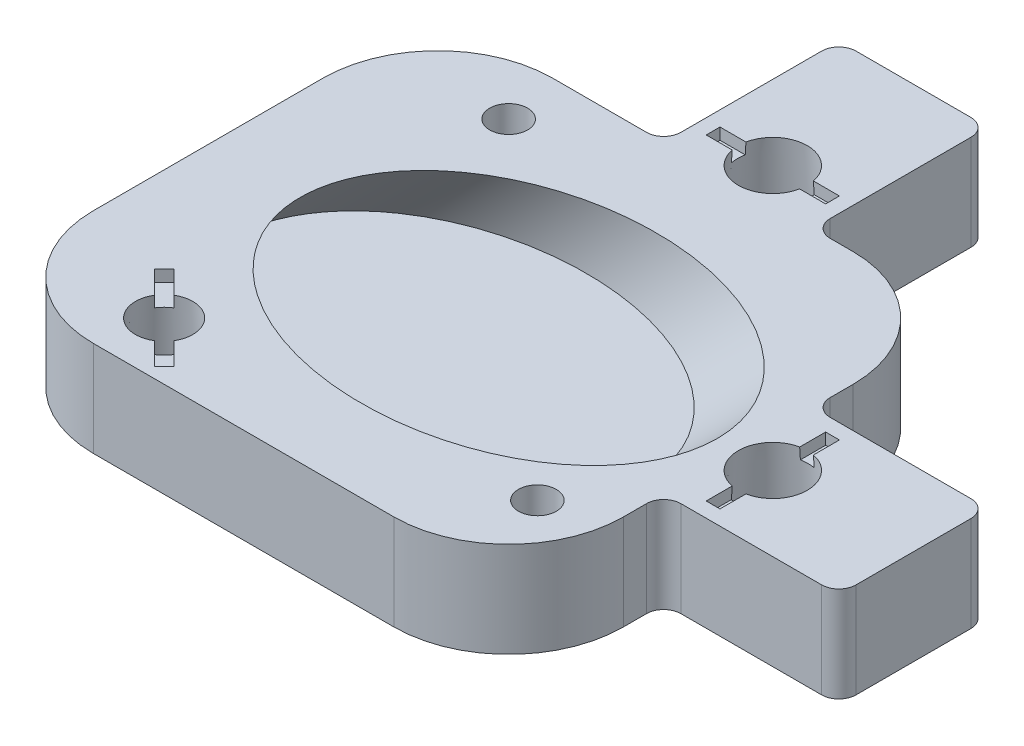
ISO-10303-21;
HEADER;
FILE_DESCRIPTION(('STEP AP214'),'2;1');
FILE_NAME('part.step','',(''),(''),'','','');
FILE_SCHEMA(('AUTOMOTIVE_DESIGN { 1 0 10303 214 1 1 1 1 }'));
ENDSEC;
DATA;
#1=APPLICATION_CONTEXT('core data for automotive mechanical design processes');
#2=APPLICATION_PROTOCOL_DEFINITION('international standard','automotive_design',2000,#1);
#3=PRODUCT_CONTEXT('',#1,'mechanical');
#4=PRODUCT('Part','Part','',(#3));
#5=PRODUCT_RELATED_PRODUCT_CATEGORY('part','',(#4));
#6=PRODUCT_DEFINITION_FORMATION('','',#4);
#7=PRODUCT_DEFINITION_CONTEXT('part definition',#1,'design');
#8=PRODUCT_DEFINITION('design','',#6,#7);
#9=PRODUCT_DEFINITION_SHAPE('','',#8);
#10=(LENGTH_UNIT() NAMED_UNIT(*) SI_UNIT(.MILLI.,.METRE.));
#11=(NAMED_UNIT(*) PLANE_ANGLE_UNIT() SI_UNIT($,.RADIAN.));
#12=(NAMED_UNIT(*) SI_UNIT($,.STERADIAN.) SOLID_ANGLE_UNIT());
#13=UNCERTAINTY_MEASURE_WITH_UNIT(LENGTH_MEASURE(1.E-05),#10,'distance_accuracy_value','');
#14=(GEOMETRIC_REPRESENTATION_CONTEXT(3) GLOBAL_UNCERTAINTY_ASSIGNED_CONTEXT((#13)) GLOBAL_UNIT_ASSIGNED_CONTEXT((#10,
#11,#12)) REPRESENTATION_CONTEXT('',''));
#15=CARTESIAN_POINT('',(0.,0.,0.));
#16=DIRECTION('',(0.,0.,1.));
#17=DIRECTION('',(1.,0.,0.));
#18=AXIS2_PLACEMENT_3D('',#15,#16,#17);
#19=CARTESIAN_POINT('',(-15.,8.3,-15.));
#20=DIRECTION('',(0.,-1.,0.));
#21=DIRECTION('',(0.,0.,-1.));
#22=AXIS2_PLACEMENT_3D('',#19,#20,#21);
#23=CYLINDRICAL_SURFACE('',#22,1.65);
#24=CARTESIAN_POINT('',(-15.,8.3,-15.));
#25=DIRECTION('',(0.,1.,0.));
#26=DIRECTION('',(0.,0.,1.));
#27=AXIS2_PLACEMENT_3D('',#24,#25,#26);
#28=CIRCLE('',#27,1.65);
#29=CARTESIAN_POINT('',(-15.,8.3,-16.65));
#30=VERTEX_POINT('',#29);
#31=EDGE_CURVE('E827',#30,#30,#28,.T.);
#32=CARTESIAN_POINT('',(-15.,3.9,-15.));
#33=DIRECTION('',(0.,-1.,0.));
#34=DIRECTION('',(0.,0.,-1.));
#35=AXIS2_PLACEMENT_3D('',#32,#33,#34);
#36=CIRCLE('',#35,1.65);
#37=CARTESIAN_POINT('',(-15.,3.9,-16.65));
#38=VERTEX_POINT('',#37);
#39=EDGE_CURVE('E700',#38,#38,#36,.T.);
#40=CARTESIAN_POINT('',(-15.,8.3,-16.65));
#41=CARTESIAN_POINT('',(-15.,8.25416666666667,-16.65));
#42=CARTESIAN_POINT('',(-15.,8.20833333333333,-16.65));
#43=CARTESIAN_POINT('',(-15.,8.11666666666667,-16.65));
#44=CARTESIAN_POINT('',(-15.,8.07083333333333,-16.65));
#45=CARTESIAN_POINT('',(-15.,7.97916666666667,-16.65));
#46=CARTESIAN_POINT('',(-15.,7.93333333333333,-16.65));
#47=CARTESIAN_POINT('',(-15.,7.84166666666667,-16.65));
#48=CARTESIAN_POINT('',(-15.,7.79583333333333,-16.65));
#49=CARTESIAN_POINT('',(-15.,7.70416666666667,-16.65));
#50=CARTESIAN_POINT('',(-15.,7.65833333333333,-16.65));
#51=CARTESIAN_POINT('',(-15.,7.56666666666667,-16.65));
#52=CARTESIAN_POINT('',(-15.,7.52083333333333,-16.65));
#53=CARTESIAN_POINT('',(-15.,7.42916666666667,-16.65));
#54=CARTESIAN_POINT('',(-15.,7.38333333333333,-16.65));
#55=CARTESIAN_POINT('',(-15.,7.29166666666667,-16.65));
#56=CARTESIAN_POINT('',(-15.,7.24583333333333,-16.65));
#57=CARTESIAN_POINT('',(-15.,7.15416666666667,-16.65));
#58=CARTESIAN_POINT('',(-15.,7.10833333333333,-16.65));
#59=CARTESIAN_POINT('',(-15.,7.01666666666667,-16.65));
#60=CARTESIAN_POINT('',(-15.,6.97083333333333,-16.65));
#61=CARTESIAN_POINT('',(-15.,6.87916666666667,-16.65));
#62=CARTESIAN_POINT('',(-15.,6.83333333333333,-16.65));
#63=CARTESIAN_POINT('',(-15.,6.74166666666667,-16.65));
#64=CARTESIAN_POINT('',(-15.,6.69583333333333,-16.65));
#65=CARTESIAN_POINT('',(-15.,6.60416666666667,-16.65));
#66=CARTESIAN_POINT('',(-15.,6.55833333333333,-16.65));
#67=CARTESIAN_POINT('',(-15.,6.46666666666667,-16.65));
#68=CARTESIAN_POINT('',(-15.,6.42083333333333,-16.65));
#69=CARTESIAN_POINT('',(-15.,6.32916666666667,-16.65));
#70=CARTESIAN_POINT('',(-15.,6.28333333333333,-16.65));
#71=CARTESIAN_POINT('',(-15.,6.19166666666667,-16.65));
#72=CARTESIAN_POINT('',(-15.,6.14583333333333,-16.65));
#73=CARTESIAN_POINT('',(-15.,6.05416666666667,-16.65));
#74=CARTESIAN_POINT('',(-15.,6.00833333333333,-16.65));
#75=CARTESIAN_POINT('',(-15.,5.91666666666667,-16.65));
#76=CARTESIAN_POINT('',(-15.,5.87083333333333,-16.65));
#77=CARTESIAN_POINT('',(-15.,5.77916666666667,-16.65));
#78=CARTESIAN_POINT('',(-15.,5.73333333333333,-16.65));
#79=CARTESIAN_POINT('',(-15.,5.64166666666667,-16.65));
#80=CARTESIAN_POINT('',(-15.,5.59583333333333,-16.65));
#81=CARTESIAN_POINT('',(-15.,5.50416666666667,-16.65));
#82=CARTESIAN_POINT('',(-15.,5.45833333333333,-16.65));
#83=CARTESIAN_POINT('',(-15.,5.36666666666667,-16.65));
#84=CARTESIAN_POINT('',(-15.,5.32083333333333,-16.65));
#85=CARTESIAN_POINT('',(-15.,5.22916666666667,-16.65));
#86=CARTESIAN_POINT('',(-15.,5.18333333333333,-16.65));
#87=CARTESIAN_POINT('',(-15.,5.09166666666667,-16.65));
#88=CARTESIAN_POINT('',(-15.,5.04583333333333,-16.65));
#89=CARTESIAN_POINT('',(-15.,4.95416666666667,-16.65));
#90=CARTESIAN_POINT('',(-15.,4.90833333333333,-16.65));
#91=CARTESIAN_POINT('',(-15.,4.81666666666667,-16.65));
#92=CARTESIAN_POINT('',(-15.,4.77083333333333,-16.65));
#93=CARTESIAN_POINT('',(-15.,4.67916666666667,-16.65));
#94=CARTESIAN_POINT('',(-15.,4.63333333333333,-16.65));
#95=CARTESIAN_POINT('',(-15.,4.54166666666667,-16.65));
#96=CARTESIAN_POINT('',(-15.,4.49583333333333,-16.65));
#97=CARTESIAN_POINT('',(-15.,4.40416666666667,-16.65));
#98=CARTESIAN_POINT('',(-15.,4.35833333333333,-16.65));
#99=CARTESIAN_POINT('',(-15.,4.26666666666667,-16.65));
#100=CARTESIAN_POINT('',(-15.,4.22083333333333,-16.65));
#101=CARTESIAN_POINT('',(-15.,4.12916666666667,-16.65));
#102=CARTESIAN_POINT('',(-15.,4.08333333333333,-16.65));
#103=CARTESIAN_POINT('',(-15.,3.99166666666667,-16.65));
#104=CARTESIAN_POINT('',(-15.,3.94583333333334,-16.65));
#105=CARTESIAN_POINT('',(-15.,3.9,-16.65));
#106=B_SPLINE_CURVE_WITH_KNOTS('',3,(#40,#41,#42,#43,#44,#45,#46,#47,#48,#49,#50,#51,#52,#53,
#54,#55,#56,#57,#58,#59,#60,#61,#62,#63,#64,#65,#66,#67,#68,#69,#70,#71,#72,#73,#74,#75,#76,#77,
#78,#79,#80,#81,#82,#83,#84,#85,#86,#87,#88,#89,#90,#91,#92,#93,#94,#95,#96,#97,#98,#99,#100,
#101,#102,#103,#104,#105),.UNSPECIFIED.,.F.,.F.,(4,2,2,2,2,2,2,2,2,2,2,2,2,2,2,2,2,2,2,2,2,2,2,
2,2,2,2,2,2,2,2,2,4),(0.,0.1375,0.275000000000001,0.412500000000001,0.55,0.687500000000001,
0.825,0.962500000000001,1.1,1.2375,1.375,1.5125,1.65,1.7875,1.925,2.0625,2.2,2.3375,2.475,
2.6125,2.75,2.8875,3.025,3.1625,3.3,3.4375,3.575,3.7125,3.85,3.9875,4.125,4.2625,4.4),.UNSPECIFIED.);
#107=EDGE_CURVE('BSEAM45',#30,#38,#106,.T.);
#108=ORIENTED_EDGE('',*,*,#31,.T.);
#109=ORIENTED_EDGE('',*,*,#39,.T.);
#110=ORIENTED_EDGE('',*,*,#107,.T.);
#111=ORIENTED_EDGE('',*,*,#107,.F.);
#112=EDGE_LOOP('',(#108,#110,#109,#111));
#113=FACE_BOUND('',#112,.T.);
#114=ADVANCED_FACE('F45',(#113),#23,.F.);
#115=CARTESIAN_POINT('',(15.,8.3,12.5));
#116=DIRECTION('',(0.,-1.,0.));
#117=DIRECTION('',(0.,0.,-1.));
#118=AXIS2_PLACEMENT_3D('',#115,#116,#117);
#119=CYLINDRICAL_SURFACE('',#118,1.65);
#120=CARTESIAN_POINT('',(15.,8.3,12.5));
#121=DIRECTION('',(0.,1.,0.));
#122=DIRECTION('',(0.,0.,1.));
#123=AXIS2_PLACEMENT_3D('',#120,#121,#122);
#124=CIRCLE('',#123,1.65);
#125=CARTESIAN_POINT('',(15.,8.3,10.85));
#126=VERTEX_POINT('',#125);
#127=EDGE_CURVE('E731',#126,#126,#124,.T.);
#128=CARTESIAN_POINT('',(15.,3.9,12.5));
#129=DIRECTION('',(0.,-1.,0.));
#130=DIRECTION('',(0.,0.,-1.));
#131=AXIS2_PLACEMENT_3D('',#128,#129,#130);
#132=CIRCLE('',#131,1.65);
#133=CARTESIAN_POINT('',(15.,3.9,10.85));
#134=VERTEX_POINT('',#133);
#135=EDGE_CURVE('E557',#134,#134,#132,.T.);
#136=CARTESIAN_POINT('',(15.,8.3,10.85));
#137=CARTESIAN_POINT('',(15.,8.25416666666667,10.85));
#138=CARTESIAN_POINT('',(15.,8.20833333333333,10.85));
#139=CARTESIAN_POINT('',(15.,8.11666666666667,10.85));
#140=CARTESIAN_POINT('',(15.,8.07083333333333,10.85));
#141=CARTESIAN_POINT('',(15.,7.97916666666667,10.85));
#142=CARTESIAN_POINT('',(15.,7.93333333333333,10.85));
#143=CARTESIAN_POINT('',(15.,7.84166666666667,10.85));
#144=CARTESIAN_POINT('',(15.,7.79583333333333,10.85));
#145=CARTESIAN_POINT('',(15.,7.70416666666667,10.85));
#146=CARTESIAN_POINT('',(15.,7.65833333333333,10.85));
#147=CARTESIAN_POINT('',(15.,7.56666666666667,10.85));
#148=CARTESIAN_POINT('',(15.,7.52083333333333,10.85));
#149=CARTESIAN_POINT('',(15.,7.42916666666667,10.85));
#150=CARTESIAN_POINT('',(15.,7.38333333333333,10.85));
#151=CARTESIAN_POINT('',(15.,7.29166666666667,10.85));
#152=CARTESIAN_POINT('',(15.,7.24583333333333,10.85));
#153=CARTESIAN_POINT('',(15.,7.15416666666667,10.85));
#154=CARTESIAN_POINT('',(15.,7.10833333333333,10.85));
#155=CARTESIAN_POINT('',(15.,7.01666666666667,10.85));
#156=CARTESIAN_POINT('',(15.,6.97083333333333,10.85));
#157=CARTESIAN_POINT('',(15.,6.87916666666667,10.85));
#158=CARTESIAN_POINT('',(15.,6.83333333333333,10.85));
#159=CARTESIAN_POINT('',(15.,6.74166666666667,10.85));
#160=CARTESIAN_POINT('',(15.,6.69583333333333,10.85));
#161=CARTESIAN_POINT('',(15.,6.60416666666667,10.85));
#162=CARTESIAN_POINT('',(15.,6.55833333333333,10.85));
#163=CARTESIAN_POINT('',(15.,6.46666666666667,10.85));
#164=CARTESIAN_POINT('',(15.,6.42083333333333,10.85));
#165=CARTESIAN_POINT('',(15.,6.32916666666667,10.85));
#166=CARTESIAN_POINT('',(15.,6.28333333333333,10.85));
#167=CARTESIAN_POINT('',(15.,6.19166666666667,10.85));
#168=CARTESIAN_POINT('',(15.,6.14583333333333,10.85));
#169=CARTESIAN_POINT('',(15.,6.05416666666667,10.85));
#170=CARTESIAN_POINT('',(15.,6.00833333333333,10.85));
#171=CARTESIAN_POINT('',(15.,5.91666666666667,10.85));
#172=CARTESIAN_POINT('',(15.,5.87083333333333,10.85));
#173=CARTESIAN_POINT('',(15.,5.77916666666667,10.85));
#174=CARTESIAN_POINT('',(15.,5.73333333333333,10.85));
#175=CARTESIAN_POINT('',(15.,5.64166666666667,10.85));
#176=CARTESIAN_POINT('',(15.,5.59583333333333,10.85));
#177=CARTESIAN_POINT('',(15.,5.50416666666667,10.85));
#178=CARTESIAN_POINT('',(15.,5.45833333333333,10.85));
#179=CARTESIAN_POINT('',(15.,5.36666666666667,10.85));
#180=CARTESIAN_POINT('',(15.,5.32083333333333,10.85));
#181=CARTESIAN_POINT('',(15.,5.22916666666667,10.85));
#182=CARTESIAN_POINT('',(15.,5.18333333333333,10.85));
#183=CARTESIAN_POINT('',(15.,5.09166666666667,10.85));
#184=CARTESIAN_POINT('',(15.,5.04583333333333,10.85));
#185=CARTESIAN_POINT('',(15.,4.95416666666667,10.85));
#186=CARTESIAN_POINT('',(15.,4.90833333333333,10.85));
#187=CARTESIAN_POINT('',(15.,4.81666666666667,10.85));
#188=CARTESIAN_POINT('',(15.,4.77083333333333,10.85));
#189=CARTESIAN_POINT('',(15.,4.67916666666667,10.85));
#190=CARTESIAN_POINT('',(15.,4.63333333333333,10.85));
#191=CARTESIAN_POINT('',(15.,4.54166666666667,10.85));
#192=CARTESIAN_POINT('',(15.,4.49583333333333,10.85));
#193=CARTESIAN_POINT('',(15.,4.40416666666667,10.85));
#194=CARTESIAN_POINT('',(15.,4.35833333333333,10.85));
#195=CARTESIAN_POINT('',(15.,4.26666666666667,10.85));
#196=CARTESIAN_POINT('',(15.,4.22083333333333,10.85));
#197=CARTESIAN_POINT('',(15.,4.12916666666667,10.85));
#198=CARTESIAN_POINT('',(15.,4.08333333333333,10.85));
#199=CARTESIAN_POINT('',(15.,3.99166666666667,10.85));
#200=CARTESIAN_POINT('',(15.,3.94583333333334,10.85));
#201=CARTESIAN_POINT('',(15.,3.9,10.85));
#202=B_SPLINE_CURVE_WITH_KNOTS('',3,(#136,#137,#138,#139,#140,#141,#142,#143,#144,#145,#146,
#147,#148,#149,#150,#151,#152,#153,#154,#155,#156,#157,#158,#159,#160,#161,#162,#163,#164,#165,
#166,#167,#168,#169,#170,#171,#172,#173,#174,#175,#176,#177,#178,#179,#180,#181,#182,#183,#184,
#185,#186,#187,#188,#189,#190,#191,#192,#193,#194,#195,#196,#197,#198,#199,#200,#201),
.UNSPECIFIED.,.F.,.F.,(4,2,2,2,2,2,2,2,2,2,2,2,2,2,2,2,2,2,2,2,2,2,2,2,2,2,2,2,2,2,2,2,4),(0.,
0.1375,0.275000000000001,0.412500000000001,0.55,0.687500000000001,0.825,0.962500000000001,1.1,
1.2375,1.375,1.5125,1.65,1.7875,1.925,2.0625,2.2,2.3375,2.475,2.6125,2.75,2.8875,3.025,3.1625,
3.3,3.4375,3.575,3.7125,3.85,3.9875,4.125,4.2625,4.4),.UNSPECIFIED.);
#203=EDGE_CURVE('BSEAM760',#126,#134,#202,.T.);
#204=ORIENTED_EDGE('',*,*,#127,.T.);
#205=ORIENTED_EDGE('',*,*,#135,.T.);
#206=ORIENTED_EDGE('',*,*,#203,.T.);
#207=ORIENTED_EDGE('',*,*,#203,.F.);
#208=EDGE_LOOP('',(#204,#206,#205,#207));
#209=FACE_BOUND('',#208,.T.);
#210=ADVANCED_FACE('F760',(#209),#119,.F.);
#211=CARTESIAN_POINT('',(0.,8.3,0.));
#212=DIRECTION('',(0.,1.,0.));
#213=DIRECTION('',(0.,0.,1.));
#214=AXIS2_PLACEMENT_3D('',#211,#212,#213);
#215=PLANE('',#214);
#216=DIRECTION('',(0.,0.,1.));
#217=VECTOR('',#216,1.);
#218=CARTESIAN_POINT('',(22.4,8.3,5.2));
#219=LINE('',#218,#217);
#220=CARTESIAN_POINT('',(22.4,8.3,-5.2));
#221=VERTEX_POINT('',#220);
#222=CARTESIAN_POINT('',(22.4,8.3,-2.93938769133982));
#223=VERTEX_POINT('',#222);
#224=EDGE_CURVE('E628',#221,#223,#219,.T.);
#225=ORIENTED_EDGE('',*,*,#224,.F.);
#226=DIRECTION('',(-1.,0.,0.));
#227=VECTOR('',#226,1.);
#228=CARTESIAN_POINT('',(22.4,8.3,-5.2));
#229=LINE('',#228,#227);
#230=CARTESIAN_POINT('',(23.6,8.3,-5.2));
#231=VERTEX_POINT('',#230);
#232=EDGE_CURVE('E638',#231,#221,#229,.T.);
#233=ORIENTED_EDGE('',*,*,#232,.F.);
#234=DIRECTION('',(0.,0.,-1.));
#235=VECTOR('',#234,1.);
#236=CARTESIAN_POINT('',(23.6,8.3,-5.2));
#237=LINE('',#236,#235);
#238=CARTESIAN_POINT('',(23.6,8.3,-2.93938769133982));
#239=VERTEX_POINT('',#238);
#240=EDGE_CURVE('E634',#239,#231,#237,.T.);
#241=ORIENTED_EDGE('',*,*,#240,.F.);
#242=CARTESIAN_POINT('',(23.,8.3,0.));
#243=DIRECTION('',(0.,1.,0.));
#244=DIRECTION('',(0.,0.,1.));
#245=AXIS2_PLACEMENT_3D('',#242,#243,#244);
#246=CIRCLE('',#245,3.);
#247=CARTESIAN_POINT('',(23.6,8.3,2.93938769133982));
#248=VERTEX_POINT('',#247);
#249=EDGE_CURVE('E862',#248,#239,#246,.T.);
#250=ORIENTED_EDGE('',*,*,#249,.F.);
#251=CARTESIAN_POINT('',(23.6,8.3,5.2));
#252=VERTEX_POINT('',#251);
#253=EDGE_CURVE('E635',#252,#248,#237,.T.);
#254=ORIENTED_EDGE('',*,*,#253,.F.);
#255=DIRECTION('',(1.,0.,0.));
#256=VECTOR('',#255,1.);
#257=CARTESIAN_POINT('',(23.6,8.3,5.2));
#258=LINE('',#257,#256);
#259=CARTESIAN_POINT('',(22.4,8.3,5.2));
#260=VERTEX_POINT('',#259);
#261=EDGE_CURVE('E630',#260,#252,#258,.T.);
#262=ORIENTED_EDGE('',*,*,#261,.F.);
#263=CARTESIAN_POINT('',(22.4,8.3,2.93938769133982));
#264=VERTEX_POINT('',#263);
#265=EDGE_CURVE('E631',#264,#260,#219,.T.);
#266=ORIENTED_EDGE('',*,*,#265,.F.);
#267=EDGE_CURVE('E865',#223,#264,#246,.T.);
#268=ORIENTED_EDGE('',*,*,#267,.F.);
#269=EDGE_LOOP('',(#225,#233,#241,#250,#254,#262,#266,#268));
#270=FACE_BOUND('',#269,.T.);
#271=DIRECTION('',(-1.,0.,0.));
#272=VECTOR('',#271,1.);
#273=CARTESIAN_POINT('',(-5.2,8.3,-23.6));
#274=LINE('',#273,#272);
#275=CARTESIAN_POINT('',(-2.93938769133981,8.3,-23.6));
#276=VERTEX_POINT('',#275);
#277=CARTESIAN_POINT('',(-5.2,8.3,-23.6));
#278=VERTEX_POINT('',#277);
#279=EDGE_CURVE('E666',#276,#278,#274,.T.);
#280=ORIENTED_EDGE('',*,*,#279,.F.);
#281=CARTESIAN_POINT('',(0.,8.3,-23.));
#282=DIRECTION('',(0.,1.,0.));
#283=DIRECTION('',(0.,0.,1.));
#284=AXIS2_PLACEMENT_3D('',#281,#282,#283);
#285=CIRCLE('',#284,3.);
#286=CARTESIAN_POINT('',(2.93938769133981,8.3,-23.6));
#287=VERTEX_POINT('',#286);
#288=EDGE_CURVE('E868',#287,#276,#285,.T.);
#289=ORIENTED_EDGE('',*,*,#288,.F.);
#290=CARTESIAN_POINT('',(5.2,8.3,-23.6));
#291=VERTEX_POINT('',#290);
#292=EDGE_CURVE('E663',#291,#287,#274,.T.);
#293=ORIENTED_EDGE('',*,*,#292,.F.);
#294=DIRECTION('',(0.,0.,-1.));
#295=VECTOR('',#294,1.);
#296=CARTESIAN_POINT('',(5.2,8.3,-23.6));
#297=LINE('',#296,#295);
#298=CARTESIAN_POINT('',(5.2,8.3,-22.4));
#299=VERTEX_POINT('',#298);
#300=EDGE_CURVE('E665',#299,#291,#297,.T.);
#301=ORIENTED_EDGE('',*,*,#300,.F.);
#302=DIRECTION('',(1.,0.,0.));
#303=VECTOR('',#302,1.);
#304=CARTESIAN_POINT('',(5.2,8.3,-22.4));
#305=LINE('',#304,#303);
#306=CARTESIAN_POINT('',(2.93938769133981,8.3,-22.4));
#307=VERTEX_POINT('',#306);
#308=EDGE_CURVE('E669',#307,#299,#305,.T.);
#309=ORIENTED_EDGE('',*,*,#308,.F.);
#310=CARTESIAN_POINT('',(-2.93938769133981,8.3,-22.4));
#311=VERTEX_POINT('',#310);
#312=EDGE_CURVE('E866',#311,#307,#285,.T.);
#313=ORIENTED_EDGE('',*,*,#312,.F.);
#314=CARTESIAN_POINT('',(-5.2,8.3,-22.4));
#315=VERTEX_POINT('',#314);
#316=EDGE_CURVE('E670',#315,#311,#305,.T.);
#317=ORIENTED_EDGE('',*,*,#316,.F.);
#318=DIRECTION('',(0.,0.,1.));
#319=VECTOR('',#318,1.);
#320=CARTESIAN_POINT('',(-5.2,8.3,-22.4));
#321=LINE('',#320,#319);
#322=EDGE_CURVE('E673',#278,#315,#321,.T.);
#323=ORIENTED_EDGE('',*,*,#322,.F.);
#324=EDGE_LOOP('',(#280,#289,#293,#301,#309,#313,#317,#323));
#325=FACE_BOUND('',#324,.T.);
#326=DIRECTION('',(-0.707106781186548,0.,-0.707106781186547));
#327=VECTOR('',#326,1.);
#328=CARTESIAN_POINT('',(-18.2526911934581,8.3,10.898780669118));
#329=LINE('',#328,#327);
#330=CARTESIAN_POINT('',(-16.2918361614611,8.3,12.859635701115));
#331=VERTEX_POINT('',#330);
#332=CARTESIAN_POINT('',(-18.2526911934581,8.3,10.898780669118));
#333=VERTEX_POINT('',#332);
#334=EDGE_CURVE('E704',#331,#333,#329,.T.);
#335=ORIENTED_EDGE('',*,*,#334,.F.);
#336=CARTESIAN_POINT('',(-15.,8.3,15.));
#337=DIRECTION('',(0.,1.,0.));
#338=DIRECTION('',(0.,0.,1.));
#339=AXIS2_PLACEMENT_3D('',#336,#337,#338);
#340=CIRCLE('',#339,2.5);
#341=CARTESIAN_POINT('',(-12.859635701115,8.3,16.2918361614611));
#342=VERTEX_POINT('',#341);
#343=EDGE_CURVE('E869',#342,#331,#340,.T.);
#344=ORIENTED_EDGE('',*,*,#343,.F.);
#345=CARTESIAN_POINT('',(-10.898780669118,8.3,18.2526911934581));
#346=VERTEX_POINT('',#345);
#347=EDGE_CURVE('E701',#346,#342,#329,.T.);
#348=ORIENTED_EDGE('',*,*,#347,.F.);
#349=DIRECTION('',(0.707106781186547,0.,-0.707106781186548));
#350=VECTOR('',#349,1.);
#351=CARTESIAN_POINT('',(-10.898780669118,8.3,18.2526911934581));
#352=LINE('',#351,#350);
#353=CARTESIAN_POINT('',(-11.7473088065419,8.3,19.101219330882));
#354=VERTEX_POINT('',#353);
#355=EDGE_CURVE('E703',#354,#346,#352,.T.);
#356=ORIENTED_EDGE('',*,*,#355,.F.);
#357=DIRECTION('',(0.707106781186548,0.,0.707106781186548));
#358=VECTOR('',#357,1.);
#359=CARTESIAN_POINT('',(-11.7473088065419,8.3,19.101219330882));
#360=LINE('',#359,#358);
#361=CARTESIAN_POINT('',(-13.7081638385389,8.3,17.140364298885));
#362=VERTEX_POINT('',#361);
#363=EDGE_CURVE('E707',#362,#354,#360,.T.);
#364=ORIENTED_EDGE('',*,*,#363,.F.);
#365=CARTESIAN_POINT('',(-17.140364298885,8.3,13.7081638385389));
#366=VERTEX_POINT('',#365);
#367=EDGE_CURVE('E870',#366,#362,#340,.T.);
#368=ORIENTED_EDGE('',*,*,#367,.F.);
#369=CARTESIAN_POINT('',(-19.101219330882,8.3,11.7473088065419));
#370=VERTEX_POINT('',#369);
#371=EDGE_CURVE('E708',#370,#366,#360,.T.);
#372=ORIENTED_EDGE('',*,*,#371,.F.);
#373=DIRECTION('',(-0.707106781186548,0.,0.707106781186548));
#374=VECTOR('',#373,1.);
#375=CARTESIAN_POINT('',(-19.101219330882,8.3,11.7473088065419));
#376=LINE('',#375,#374);
#377=EDGE_CURVE('E662',#333,#370,#376,.T.);
#378=ORIENTED_EDGE('',*,*,#377,.F.);
#379=EDGE_LOOP('',(#335,#344,#348,#356,#364,#368,#372,#378));
#380=FACE_BOUND('',#379,.T.);
#381=CARTESIAN_POINT('',(9.08500000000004,17.385,0.));
#382=DIRECTION('',(0.707106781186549,0.707106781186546,0.));
#383=DIRECTION('',(0.707003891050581,-0.707003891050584,0.0170586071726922));
#384=AXIS2_PLACEMENT_3D('',#381,#382,#383);
#385=CIRCLE('',#384,12.85);
#386=CARTESIAN_POINT('',(18.17,8.3,0.219203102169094));
#387=VERTEX_POINT('',#386);
#388=CARTESIAN_POINT('',(18.17,8.3,-0.2192031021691));
#389=VERTEX_POINT('',#388);
#390=EDGE_CURVE('E735',#387,#389,#385,.T.);
#391=ORIENTED_EDGE('',*,*,#390,.F.);
#392=CARTESIAN_POINT('',(0.,8.3,0.));
#393=DIRECTION('',(0.,1.,0.));
#394=DIRECTION('',(1.,0.,0.));
#395=AXIS2_PLACEMENT_3D('',#392,#393,#394);
#396=ELLIPSE('',#395,18.1726442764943,12.85);
#397=EDGE_CURVE('E780',#389,#387,#396,.T.);
#398=ORIENTED_EDGE('',*,*,#397,.F.);
#399=EDGE_LOOP('',(#391,#398));
#400=FACE_BOUND('',#399,.T.);
#401=DIRECTION('',(1.,0.,0.));
#402=VECTOR('',#401,1.);
#403=CARTESIAN_POINT('',(-26.17,8.3,20.));
#404=LINE('',#403,#402);
#405=CARTESIAN_POINT('',(-16.17,8.3,20.));
#406=VERTEX_POINT('',#405);
#407=CARTESIAN_POINT('',(10.,8.3,20.));
#408=VERTEX_POINT('',#407);
#409=EDGE_CURVE('E795',#406,#408,#404,.T.);
#410=ORIENTED_EDGE('',*,*,#409,.T.);
#411=CARTESIAN_POINT('',(10.,8.3,10.));
#412=DIRECTION('',(0.,1.,0.));
#413=DIRECTION('',(0.,0.,1.));
#414=AXIS2_PLACEMENT_3D('',#411,#412,#413);
#415=CIRCLE('',#414,10.);
#416=CARTESIAN_POINT('',(20.,8.3,10.));
#417=VERTEX_POINT('',#416);
#418=EDGE_CURVE('E1881',#408,#417,#415,.T.);
#419=ORIENTED_EDGE('',*,*,#418,.T.);
#420=DIRECTION('',(0.,0.,-1.));
#421=VECTOR('',#420,1.);
#422=CARTESIAN_POINT('',(20.,8.3,20.));
#423=LINE('',#422,#421);
#424=CARTESIAN_POINT('',(20.,8.3,8.));
#425=VERTEX_POINT('',#424);
#426=EDGE_CURVE('E856',#417,#425,#423,.T.);
#427=ORIENTED_EDGE('',*,*,#426,.T.);
#428=CARTESIAN_POINT('',(21.5,8.3,8.));
#429=DIRECTION('',(0.,1.,0.));
#430=DIRECTION('',(0.,0.,1.));
#431=AXIS2_PLACEMENT_3D('',#428,#429,#430);
#432=CIRCLE('',#431,1.5);
#433=CARTESIAN_POINT('',(21.5,8.3,6.5));
#434=VERTEX_POINT('',#433);
#435=EDGE_CURVE('E1927',#425,#434,#432,.F.);
#436=ORIENTED_EDGE('',*,*,#435,.T.);
#437=DIRECTION('',(1.,0.,0.));
#438=VECTOR('',#437,1.);
#439=CARTESIAN_POINT('',(20.,8.3,6.5));
#440=LINE('',#439,#438);
#441=CARTESIAN_POINT('',(33.75,8.3,6.5));
#442=VERTEX_POINT('',#441);
#443=EDGE_CURVE('E853',#434,#442,#440,.T.);
#444=ORIENTED_EDGE('',*,*,#443,.T.);
#445=CARTESIAN_POINT('',(33.75,8.3,5.));
#446=DIRECTION('',(0.,1.,0.));
#447=DIRECTION('',(0.,0.,1.));
#448=AXIS2_PLACEMENT_3D('',#445,#446,#447);
#449=CIRCLE('',#448,1.5);
#450=CARTESIAN_POINT('',(35.25,8.3,5.));
#451=VERTEX_POINT('',#450);
#452=EDGE_CURVE('E1979',#442,#451,#449,.T.);
#453=ORIENTED_EDGE('',*,*,#452,.T.);
#454=DIRECTION('',(0.,0.,-1.));
#455=VECTOR('',#454,1.);
#456=CARTESIAN_POINT('',(35.25,8.3,6.5));
#457=LINE('',#456,#455);
#458=CARTESIAN_POINT('',(35.25,8.3,-5.));
#459=VERTEX_POINT('',#458);
#460=EDGE_CURVE('E850',#451,#459,#457,.T.);
#461=ORIENTED_EDGE('',*,*,#460,.T.);
#462=CARTESIAN_POINT('',(33.75,8.3,-5.));
#463=DIRECTION('',(0.,1.,0.));
#464=DIRECTION('',(0.,0.,1.));
#465=AXIS2_PLACEMENT_3D('',#462,#463,#464);
#466=CIRCLE('',#465,1.5);
#467=CARTESIAN_POINT('',(33.75,8.3,-6.5));
#468=VERTEX_POINT('',#467);
#469=EDGE_CURVE('E1977',#459,#468,#466,.T.);
#470=ORIENTED_EDGE('',*,*,#469,.T.);
#471=DIRECTION('',(-1.,0.,0.));
#472=VECTOR('',#471,1.);
#473=CARTESIAN_POINT('',(35.25,8.3,-6.5));
#474=LINE('',#473,#472);
#475=CARTESIAN_POINT('',(21.5,8.3,-6.5));
#476=VERTEX_POINT('',#475);
#477=EDGE_CURVE('E847',#468,#476,#474,.T.);
#478=ORIENTED_EDGE('',*,*,#477,.T.);
#479=CARTESIAN_POINT('',(21.5,8.3,-8.));
#480=DIRECTION('',(0.,1.,0.));
#481=DIRECTION('',(0.,0.,1.));
#482=AXIS2_PLACEMENT_3D('',#479,#480,#481);
#483=CIRCLE('',#482,1.5);
#484=CARTESIAN_POINT('',(20.,8.3,-8.));
#485=VERTEX_POINT('',#484);
#486=EDGE_CURVE('E1932',#476,#485,#483,.F.);
#487=ORIENTED_EDGE('',*,*,#486,.T.);
#488=DIRECTION('',(0.,0.,-1.));
#489=VECTOR('',#488,1.);
#490=CARTESIAN_POINT('',(20.,8.3,-6.5));
#491=LINE('',#490,#489);
#492=CARTESIAN_POINT('',(20.,8.3,-10.));
#493=VERTEX_POINT('',#492);
#494=EDGE_CURVE('E844',#485,#493,#491,.T.);
#495=ORIENTED_EDGE('',*,*,#494,.T.);
#496=CARTESIAN_POINT('',(10.,8.3,-10.));
#497=DIRECTION('',(0.,1.,0.));
#498=DIRECTION('',(0.,0.,1.));
#499=AXIS2_PLACEMENT_3D('',#496,#497,#498);
#500=CIRCLE('',#499,10.);
#501=CARTESIAN_POINT('',(10.,8.3,-20.));
#502=VERTEX_POINT('',#501);
#503=EDGE_CURVE('E1884',#493,#502,#500,.T.);
#504=ORIENTED_EDGE('',*,*,#503,.T.);
#505=DIRECTION('',(-1.,0.,0.));
#506=VECTOR('',#505,1.);
#507=CARTESIAN_POINT('',(20.,8.3,-20.));
#508=LINE('',#507,#506);
#509=CARTESIAN_POINT('',(8.,8.3,-20.));
#510=VERTEX_POINT('',#509);
#511=EDGE_CURVE('E842',#502,#510,#508,.T.);
#512=ORIENTED_EDGE('',*,*,#511,.T.);
#513=CARTESIAN_POINT('',(8.,8.3,-21.5));
#514=DIRECTION('',(0.,1.,0.));
#515=DIRECTION('',(0.,0.,1.));
#516=AXIS2_PLACEMENT_3D('',#513,#514,#515);
#517=CIRCLE('',#516,1.5);
#518=CARTESIAN_POINT('',(6.5,8.3,-21.5));
#519=VERTEX_POINT('',#518);
#520=EDGE_CURVE('E1936',#510,#519,#517,.F.);
#521=ORIENTED_EDGE('',*,*,#520,.T.);
#522=DIRECTION('',(0.,0.,-1.));
#523=VECTOR('',#522,1.);
#524=CARTESIAN_POINT('',(6.5,8.3,-20.));
#525=LINE('',#524,#523);
#526=CARTESIAN_POINT('',(6.5,8.3,-33.75));
#527=VERTEX_POINT('',#526);
#528=EDGE_CURVE('E839',#519,#527,#525,.T.);
#529=ORIENTED_EDGE('',*,*,#528,.T.);
#530=CARTESIAN_POINT('',(5.,8.3,-33.75));
#531=DIRECTION('',(0.,1.,0.));
#532=DIRECTION('',(0.,0.,1.));
#533=AXIS2_PLACEMENT_3D('',#530,#531,#532);
#534=CIRCLE('',#533,1.5);
#535=CARTESIAN_POINT('',(5.,8.3,-35.25));
#536=VERTEX_POINT('',#535);
#537=EDGE_CURVE('E1975',#527,#536,#534,.T.);
#538=ORIENTED_EDGE('',*,*,#537,.T.);
#539=DIRECTION('',(-1.,0.,0.));
#540=VECTOR('',#539,1.);
#541=CARTESIAN_POINT('',(6.5,8.3,-35.25));
#542=LINE('',#541,#540);
#543=CARTESIAN_POINT('',(-5.,8.3,-35.25));
#544=VERTEX_POINT('',#543);
#545=EDGE_CURVE('E836',#536,#544,#542,.T.);
#546=ORIENTED_EDGE('',*,*,#545,.T.);
#547=CARTESIAN_POINT('',(-5.,8.3,-33.75));
#548=DIRECTION('',(0.,1.,0.));
#549=DIRECTION('',(0.,0.,1.));
#550=AXIS2_PLACEMENT_3D('',#547,#548,#549);
#551=CIRCLE('',#550,1.5);
#552=CARTESIAN_POINT('',(-6.5,8.3,-33.75));
#553=VERTEX_POINT('',#552);
#554=EDGE_CURVE('E1973',#544,#553,#551,.T.);
#555=ORIENTED_EDGE('',*,*,#554,.T.);
#556=DIRECTION('',(0.,0.,1.));
#557=VECTOR('',#556,1.);
#558=CARTESIAN_POINT('',(-6.5,8.3,-35.25));
#559=LINE('',#558,#557);
#560=CARTESIAN_POINT('',(-6.5,8.3,-21.5));
#561=VERTEX_POINT('',#560);
#562=EDGE_CURVE('E833',#553,#561,#559,.T.);
#563=ORIENTED_EDGE('',*,*,#562,.T.);
#564=CARTESIAN_POINT('',(-8.,8.3,-21.5));
#565=DIRECTION('',(0.,1.,0.));
#566=DIRECTION('',(0.,0.,1.));
#567=AXIS2_PLACEMENT_3D('',#564,#565,#566);
#568=CIRCLE('',#567,1.5);
#569=CARTESIAN_POINT('',(-8.,8.3,-20.));
#570=VERTEX_POINT('',#569);
#571=EDGE_CURVE('E1913',#561,#570,#568,.F.);
#572=ORIENTED_EDGE('',*,*,#571,.T.);
#573=DIRECTION('',(-1.,0.,0.));
#574=VECTOR('',#573,1.);
#575=CARTESIAN_POINT('',(-6.5,8.3,-20.));
#576=LINE('',#575,#574);
#577=CARTESIAN_POINT('',(-16.17,8.3,-20.));
#578=VERTEX_POINT('',#577);
#579=EDGE_CURVE('E830',#570,#578,#576,.T.);
#580=ORIENTED_EDGE('',*,*,#579,.T.);
#581=CARTESIAN_POINT('',(-16.17,8.3,-10.));
#582=DIRECTION('',(0.,1.,0.));
#583=DIRECTION('',(0.,0.,1.));
#584=AXIS2_PLACEMENT_3D('',#581,#582,#583);
#585=CIRCLE('',#584,10.);
#586=CARTESIAN_POINT('',(-26.17,8.3,-10.));
#587=VERTEX_POINT('',#586);
#588=EDGE_CURVE('E1882',#578,#587,#585,.T.);
#589=ORIENTED_EDGE('',*,*,#588,.T.);
#590=DIRECTION('',(0.,0.,1.));
#591=VECTOR('',#590,1.);
#592=CARTESIAN_POINT('',(-26.17,8.3,-20.));
#593=LINE('',#592,#591);
#594=CARTESIAN_POINT('',(-26.17,8.3,10.));
#595=VERTEX_POINT('',#594);
#596=EDGE_CURVE('E787',#587,#595,#593,.T.);
#597=ORIENTED_EDGE('',*,*,#596,.T.);
#598=CARTESIAN_POINT('',(-16.17,8.3,10.));
#599=DIRECTION('',(0.,1.,0.));
#600=DIRECTION('',(0.,0.,1.));
#601=AXIS2_PLACEMENT_3D('',#598,#599,#600);
#602=CIRCLE('',#601,10.);
#603=EDGE_CURVE('E1890',#595,#406,#602,.T.);
#604=ORIENTED_EDGE('',*,*,#603,.T.);
#605=EDGE_LOOP('',(#410,#419,#427,#436,#444,#453,#461,#470,#478,#487,#495,#504,#512,#521,#529,
#538,#546,#555,#563,#572,#580,#589,#597,#604));
#606=FACE_BOUND('',#605,.T.);
#607=ORIENTED_EDGE('',*,*,#31,.F.);
#608=EDGE_LOOP('',(#607));
#609=FACE_BOUND('',#608,.T.);
#610=ORIENTED_EDGE('',*,*,#127,.F.);
#611=EDGE_LOOP('',(#610));
#612=FACE_BOUND('',#611,.T.);
#613=ADVANCED_FACE('F763',(#270,#325,#380,#400,#606,#609,#612),#215,.T.);
#614=CARTESIAN_POINT('',(0.,0.,0.));
#615=DIRECTION('',(0.,1.,0.));
#616=DIRECTION('',(0.,0.,1.));
#617=AXIS2_PLACEMENT_3D('',#614,#615,#616);
#618=PLANE('',#617);
#619=DIRECTION('',(0.,0.,1.));
#620=VECTOR('',#619,1.);
#621=CARTESIAN_POINT('',(34.25,0.,0.6));
#622=LINE('',#621,#620);
#623=CARTESIAN_POINT('',(34.25,0.,-0.8));
#624=VERTEX_POINT('',#623);
#625=CARTESIAN_POINT('',(34.25,0.,0.8));
#626=VERTEX_POINT('',#625);
#627=EDGE_CURVE('E1093',#624,#626,#622,.T.);
#628=ORIENTED_EDGE('',*,*,#627,.F.);
#629=DIRECTION('',(1.,0.,0.));
#630=VECTOR('',#629,1.);
#631=CARTESIAN_POINT('',(0.,0.,-0.800000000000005));
#632=LINE('',#631,#630);
#633=CARTESIAN_POINT('',(27.25,0.,-0.800000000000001));
#634=VERTEX_POINT('',#633);
#635=EDGE_CURVE('E1011',#624,#634,#632,.F.);
#636=ORIENTED_EDGE('',*,*,#635,.T.);
#637=DIRECTION('',(0.,0.,-1.));
#638=VECTOR('',#637,1.);
#639=CARTESIAN_POINT('',(27.25,0.,-0.600000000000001));
#640=LINE('',#639,#638);
#641=CARTESIAN_POINT('',(27.25,0.,0.800000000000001));
#642=VERTEX_POINT('',#641);
#643=EDGE_CURVE('E1096',#642,#634,#640,.T.);
#644=ORIENTED_EDGE('',*,*,#643,.F.);
#645=DIRECTION('',(-1.,0.,0.));
#646=VECTOR('',#645,1.);
#647=CARTESIAN_POINT('',(0.,0.,0.800000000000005));
#648=LINE('',#647,#646);
#649=EDGE_CURVE('E1006',#642,#626,#648,.F.);
#650=ORIENTED_EDGE('',*,*,#649,.T.);
#651=EDGE_LOOP('',(#628,#636,#644,#650));
#652=FACE_BOUND('',#651,.T.);
#653=DIRECTION('',(1.,0.,0.));
#654=VECTOR('',#653,1.);
#655=CARTESIAN_POINT('',(0.600000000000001,0.,-34.25));
#656=LINE('',#655,#654);
#657=CARTESIAN_POINT('',(-0.800000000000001,0.,-34.25));
#658=VERTEX_POINT('',#657);
#659=CARTESIAN_POINT('',(0.800000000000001,0.,-34.25));
#660=VERTEX_POINT('',#659);
#661=EDGE_CURVE('E1098',#658,#660,#656,.T.);
#662=ORIENTED_EDGE('',*,*,#661,.F.);
#663=DIRECTION('',(0.,0.,-1.));
#664=VECTOR('',#663,1.);
#665=CARTESIAN_POINT('',(-0.800000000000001,0.,0.));
#666=LINE('',#665,#664);
#667=CARTESIAN_POINT('',(-0.800000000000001,0.,-27.25));
#668=VERTEX_POINT('',#667);
#669=EDGE_CURVE('E1017',#658,#668,#666,.F.);
#670=ORIENTED_EDGE('',*,*,#669,.T.);
#671=DIRECTION('',(-1.,0.,0.));
#672=VECTOR('',#671,1.);
#673=CARTESIAN_POINT('',(-0.600000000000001,0.,-27.25));
#674=LINE('',#673,#672);
#675=CARTESIAN_POINT('',(0.800000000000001,0.,-27.25));
#676=VERTEX_POINT('',#675);
#677=EDGE_CURVE('E1100',#676,#668,#674,.T.);
#678=ORIENTED_EDGE('',*,*,#677,.F.);
#679=DIRECTION('',(0.,0.,1.));
#680=VECTOR('',#679,1.);
#681=CARTESIAN_POINT('',(0.800000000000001,0.,0.));
#682=LINE('',#681,#680);
#683=EDGE_CURVE('E1014',#676,#660,#682,.F.);
#684=ORIENTED_EDGE('',*,*,#683,.T.);
#685=EDGE_LOOP('',(#662,#670,#678,#684));
#686=FACE_BOUND('',#685,.T.);
#687=CARTESIAN_POINT('',(-15.,0.,15.));
#688=DIRECTION('',(0.,1.,0.));
#689=DIRECTION('',(0.,0.,1.));
#690=AXIS2_PLACEMENT_3D('',#687,#688,#689);
#691=CIRCLE('',#690,2.99999999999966);
#692=CARTESIAN_POINT('',(-15.,0.,17.9999999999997));
#693=VERTEX_POINT('',#692);
#694=EDGE_CURVE('E896',#693,#693,#691,.T.);
#695=ORIENTED_EDGE('',*,*,#694,.T.);
#696=EDGE_LOOP('',(#695));
#697=FACE_BOUND('',#696,.T.);
#698=CARTESIAN_POINT('',(23.,0.,0.));
#699=DIRECTION('',(0.,1.,0.));
#700=DIRECTION('',(0.,0.,1.));
#701=AXIS2_PLACEMENT_3D('',#698,#699,#700);
#702=CIRCLE('',#701,3.50000000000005);
#703=CARTESIAN_POINT('',(23.,0.,3.50000000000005));
#704=VERTEX_POINT('',#703);
#705=EDGE_CURVE('E893',#704,#704,#702,.T.);
#706=ORIENTED_EDGE('',*,*,#705,.T.);
#707=EDGE_LOOP('',(#706));
#708=FACE_BOUND('',#707,.T.);
#709=CARTESIAN_POINT('',(0.,0.,-23.));
#710=DIRECTION('',(0.,1.,0.));
#711=DIRECTION('',(0.,0.,1.));
#712=AXIS2_PLACEMENT_3D('',#709,#710,#711);
#713=CIRCLE('',#712,3.49999999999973);
#714=CARTESIAN_POINT('',(0.,0.,-19.5000000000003));
#715=VERTEX_POINT('',#714);
#716=EDGE_CURVE('E890',#715,#715,#713,.T.);
#717=ORIENTED_EDGE('',*,*,#716,.T.);
#718=EDGE_LOOP('',(#717));
#719=FACE_BOUND('',#718,.T.);
#720=DIRECTION('',(-1.,0.,0.));
#721=VECTOR('',#720,1.);
#722=CARTESIAN_POINT('',(-13.2390816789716,0.,-11.95));
#723=LINE('',#722,#721);
#724=CARTESIAN_POINT('',(-13.2390816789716,0.,-11.95));
#725=VERTEX_POINT('',#724);
#726=CARTESIAN_POINT('',(-16.7609183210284,0.,-11.95));
#727=VERTEX_POINT('',#726);
#728=EDGE_CURVE('E544',#725,#727,#723,.T.);
#729=ORIENTED_EDGE('',*,*,#728,.F.);
#730=DIRECTION('',(-0.5,0.,0.866025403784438));
#731=VECTOR('',#730,1.);
#732=CARTESIAN_POINT('',(-11.4781633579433,0.,-15.));
#733=LINE('',#732,#731);
#734=CARTESIAN_POINT('',(-11.4781633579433,0.,-15.));
#735=VERTEX_POINT('',#734);
#736=EDGE_CURVE('E509',#735,#725,#733,.T.);
#737=ORIENTED_EDGE('',*,*,#736,.F.);
#738=DIRECTION('',(0.5,0.,0.866025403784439));
#739=VECTOR('',#738,1.);
#740=CARTESIAN_POINT('',(-13.2390816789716,0.,-18.05));
#741=LINE('',#740,#739);
#742=CARTESIAN_POINT('',(-13.2390816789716,0.,-18.05));
#743=VERTEX_POINT('',#742);
#744=EDGE_CURVE('E527',#743,#735,#741,.T.);
#745=ORIENTED_EDGE('',*,*,#744,.F.);
#746=DIRECTION('',(1.,0.,0.));
#747=VECTOR('',#746,1.);
#748=CARTESIAN_POINT('',(-16.7609183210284,0.,-18.05));
#749=LINE('',#748,#747);
#750=CARTESIAN_POINT('',(-16.7609183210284,0.,-18.05));
#751=VERTEX_POINT('',#750);
#752=EDGE_CURVE('E530',#751,#743,#749,.T.);
#753=ORIENTED_EDGE('',*,*,#752,.F.);
#754=DIRECTION('',(0.499999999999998,0.,-0.86602540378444));
#755=VECTOR('',#754,1.);
#756=CARTESIAN_POINT('',(-18.5218366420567,0.,-15.));
#757=LINE('',#756,#755);
#758=CARTESIAN_POINT('',(-18.5218366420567,0.,-15.));
#759=VERTEX_POINT('',#758);
#760=EDGE_CURVE('E550',#759,#751,#757,.T.);
#761=ORIENTED_EDGE('',*,*,#760,.F.);
#762=DIRECTION('',(-0.499999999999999,0.,-0.866025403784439));
#763=VECTOR('',#762,1.);
#764=CARTESIAN_POINT('',(-16.7609183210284,0.,-11.95));
#765=LINE('',#764,#763);
#766=EDGE_CURVE('E547',#727,#759,#765,.T.);
#767=ORIENTED_EDGE('',*,*,#766,.F.);
#768=EDGE_LOOP('',(#729,#737,#745,#753,#761,#767));
#769=FACE_BOUND('',#768,.T.);
#770=DIRECTION('',(-0.866025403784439,0.,0.5));
#771=VECTOR('',#770,1.);
#772=CARTESIAN_POINT('',(18.05,0.,14.2609183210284));
#773=LINE('',#772,#771);
#774=CARTESIAN_POINT('',(18.05,0.,14.2609183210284));
#775=VERTEX_POINT('',#774);
#776=CARTESIAN_POINT('',(15.,0.,16.0218366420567));
#777=VERTEX_POINT('',#776);
#778=EDGE_CURVE('E593',#775,#777,#773,.T.);
#779=ORIENTED_EDGE('',*,*,#778,.F.);
#780=DIRECTION('',(0.,0.,1.));
#781=VECTOR('',#780,1.);
#782=CARTESIAN_POINT('',(18.05,0.,10.7390816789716));
#783=LINE('',#782,#781);
#784=CARTESIAN_POINT('',(18.05,0.,10.7390816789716));
#785=VERTEX_POINT('',#784);
#786=EDGE_CURVE('E545',#785,#775,#783,.T.);
#787=ORIENTED_EDGE('',*,*,#786,.F.);
#788=DIRECTION('',(0.866025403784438,0.,0.5));
#789=VECTOR('',#788,1.);
#790=CARTESIAN_POINT('',(15.,0.,8.97816335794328));
#791=LINE('',#790,#789);
#792=CARTESIAN_POINT('',(15.,0.,8.97816335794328));
#793=VERTEX_POINT('',#792);
#794=EDGE_CURVE('E580',#793,#785,#791,.T.);
#795=ORIENTED_EDGE('',*,*,#794,.F.);
#796=DIRECTION('',(0.866025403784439,0.,-0.5));
#797=VECTOR('',#796,1.);
#798=CARTESIAN_POINT('',(11.95,0.,10.7390816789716));
#799=LINE('',#798,#797);
#800=CARTESIAN_POINT('',(11.95,0.,10.7390816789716));
#801=VERTEX_POINT('',#800);
#802=EDGE_CURVE('E583',#801,#793,#799,.T.);
#803=ORIENTED_EDGE('',*,*,#802,.F.);
#804=DIRECTION('',(0.,0.,-1.));
#805=VECTOR('',#804,1.);
#806=CARTESIAN_POINT('',(11.95,0.,14.2609183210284));
#807=LINE('',#806,#805);
#808=CARTESIAN_POINT('',(11.95,0.,14.2609183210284));
#809=VERTEX_POINT('',#808);
#810=EDGE_CURVE('E587',#809,#801,#807,.T.);
#811=ORIENTED_EDGE('',*,*,#810,.F.);
#812=DIRECTION('',(-0.866025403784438,0.,-0.500000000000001));
#813=VECTOR('',#812,1.);
#814=CARTESIAN_POINT('',(15.,0.,16.0218366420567));
#815=LINE('',#814,#813);
#816=EDGE_CURVE('E590',#777,#809,#815,.T.);
#817=ORIENTED_EDGE('',*,*,#816,.F.);
#818=EDGE_LOOP('',(#779,#787,#795,#803,#811,#817));
#819=FACE_BOUND('',#818,.T.);
#820=CARTESIAN_POINT('',(0.,0.,0.));
#821=DIRECTION('',(0.,-1.,0.));
#822=DIRECTION('',(0.,0.,-1.));
#823=AXIS2_PLACEMENT_3D('',#820,#821,#822);
#824=CIRCLE('',#823,2.24499443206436);
#825=CARTESIAN_POINT('',(0.,0.,-2.24499443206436));
#826=VERTEX_POINT('',#825);
#827=EDGE_CURVE('E643',#826,#826,#824,.T.);
#828=ORIENTED_EDGE('',*,*,#827,.F.);
#829=EDGE_LOOP('',(#828));
#830=FACE_BOUND('',#829,.T.);
#831=DIRECTION('',(0.,0.,-1.));
#832=VECTOR('',#831,1.);
#833=CARTESIAN_POINT('',(20.,0.,20.));
#834=LINE('',#833,#832);
#835=CARTESIAN_POINT('',(20.,0.,10.));
#836=VERTEX_POINT('',#835);
#837=CARTESIAN_POINT('',(20.,0.,8.));
#838=VERTEX_POINT('',#837);
#839=EDGE_CURVE('E822',#836,#838,#834,.T.);
#840=ORIENTED_EDGE('',*,*,#839,.F.);
#841=CARTESIAN_POINT('',(10.,0.,10.));
#842=DIRECTION('',(0.,1.,0.));
#843=DIRECTION('',(0.,0.,1.));
#844=AXIS2_PLACEMENT_3D('',#841,#842,#843);
#845=CIRCLE('',#844,10.);
#846=CARTESIAN_POINT('',(10.,0.,20.));
#847=VERTEX_POINT('',#846);
#848=EDGE_CURVE('E1879',#836,#847,#845,.F.);
#849=ORIENTED_EDGE('',*,*,#848,.T.);
#850=DIRECTION('',(1.,0.,0.));
#851=VECTOR('',#850,1.);
#852=CARTESIAN_POINT('',(-26.17,0.,20.));
#853=LINE('',#852,#851);
#854=CARTESIAN_POINT('',(-16.17,0.,20.));
#855=VERTEX_POINT('',#854);
#856=EDGE_CURVE('E824',#855,#847,#853,.T.);
#857=ORIENTED_EDGE('',*,*,#856,.F.);
#858=CARTESIAN_POINT('',(-16.17,0.,10.));
#859=DIRECTION('',(0.,1.,0.));
#860=DIRECTION('',(0.,0.,1.));
#861=AXIS2_PLACEMENT_3D('',#858,#859,#860);
#862=CIRCLE('',#861,10.);
#863=CARTESIAN_POINT('',(-26.17,0.,10.));
#864=VERTEX_POINT('',#863);
#865=EDGE_CURVE('E1919',#855,#864,#862,.F.);
#866=ORIENTED_EDGE('',*,*,#865,.T.);
#867=DIRECTION('',(0.,0.,1.));
#868=VECTOR('',#867,1.);
#869=CARTESIAN_POINT('',(-26.17,0.,-20.));
#870=LINE('',#869,#868);
#871=CARTESIAN_POINT('',(-26.17,0.,-10.));
#872=VERTEX_POINT('',#871);
#873=EDGE_CURVE('E792',#872,#864,#870,.T.);
#874=ORIENTED_EDGE('',*,*,#873,.F.);
#875=CARTESIAN_POINT('',(-16.17,0.,-10.));
#876=DIRECTION('',(0.,1.,0.));
#877=DIRECTION('',(0.,0.,1.));
#878=AXIS2_PLACEMENT_3D('',#875,#876,#877);
#879=CIRCLE('',#878,10.);
#880=CARTESIAN_POINT('',(-16.17,0.,-20.));
#881=VERTEX_POINT('',#880);
#882=EDGE_CURVE('E1915',#872,#881,#879,.F.);
#883=ORIENTED_EDGE('',*,*,#882,.T.);
#884=DIRECTION('',(-1.,0.,0.));
#885=VECTOR('',#884,1.);
#886=CARTESIAN_POINT('',(-6.5,0.,-20.));
#887=LINE('',#886,#885);
#888=CARTESIAN_POINT('',(-8.,0.,-20.));
#889=VERTEX_POINT('',#888);
#890=EDGE_CURVE('E796',#889,#881,#887,.T.);
#891=ORIENTED_EDGE('',*,*,#890,.F.);
#892=CARTESIAN_POINT('',(-8.,0.,-21.5));
#893=DIRECTION('',(0.,1.,0.));
#894=DIRECTION('',(0.,0.,1.));
#895=AXIS2_PLACEMENT_3D('',#892,#893,#894);
#896=CIRCLE('',#895,1.5);
#897=CARTESIAN_POINT('',(-6.5,0.,-21.5));
#898=VERTEX_POINT('',#897);
#899=EDGE_CURVE('E1942',#889,#898,#896,.T.);
#900=ORIENTED_EDGE('',*,*,#899,.T.);
#901=DIRECTION('',(0.,0.,1.));
#902=VECTOR('',#901,1.);
#903=CARTESIAN_POINT('',(-6.5,0.,-35.25));
#904=LINE('',#903,#902);
#905=CARTESIAN_POINT('',(-6.5,0.,-33.75));
#906=VERTEX_POINT('',#905);
#907=EDGE_CURVE('E799',#906,#898,#904,.T.);
#908=ORIENTED_EDGE('',*,*,#907,.F.);
#909=CARTESIAN_POINT('',(-5.,0.,-33.75));
#910=DIRECTION('',(0.,1.,0.));
#911=DIRECTION('',(0.,0.,1.));
#912=AXIS2_PLACEMENT_3D('',#909,#910,#911);
#913=CIRCLE('',#912,1.5);
#914=CARTESIAN_POINT('',(-5.,0.,-35.25));
#915=VERTEX_POINT('',#914);
#916=EDGE_CURVE('E1986',#906,#915,#913,.F.);
#917=ORIENTED_EDGE('',*,*,#916,.T.);
#918=DIRECTION('',(-1.,0.,0.));
#919=VECTOR('',#918,1.);
#920=CARTESIAN_POINT('',(6.5,0.,-35.25));
#921=LINE('',#920,#919);
#922=CARTESIAN_POINT('',(5.,0.,-35.25));
#923=VERTEX_POINT('',#922);
#924=EDGE_CURVE('E802',#923,#915,#921,.T.);
#925=ORIENTED_EDGE('',*,*,#924,.F.);
#926=CARTESIAN_POINT('',(5.,0.,-33.75));
#927=DIRECTION('',(0.,1.,0.));
#928=DIRECTION('',(0.,0.,1.));
#929=AXIS2_PLACEMENT_3D('',#926,#927,#928);
#930=CIRCLE('',#929,1.5);
#931=CARTESIAN_POINT('',(6.5,0.,-33.75));
#932=VERTEX_POINT('',#931);
#933=EDGE_CURVE('E1988',#923,#932,#930,.F.);
#934=ORIENTED_EDGE('',*,*,#933,.T.);
#935=DIRECTION('',(0.,0.,-1.));
#936=VECTOR('',#935,1.);
#937=CARTESIAN_POINT('',(6.5,0.,-20.));
#938=LINE('',#937,#936);
#939=CARTESIAN_POINT('',(6.5,0.,-21.5));
#940=VERTEX_POINT('',#939);
#941=EDGE_CURVE('E805',#940,#932,#938,.T.);
#942=ORIENTED_EDGE('',*,*,#941,.F.);
#943=CARTESIAN_POINT('',(8.,0.,-21.5));
#944=DIRECTION('',(0.,1.,0.));
#945=DIRECTION('',(0.,0.,1.));
#946=AXIS2_PLACEMENT_3D('',#943,#944,#945);
#947=CIRCLE('',#946,1.5);
#948=CARTESIAN_POINT('',(8.,0.,-20.));
#949=VERTEX_POINT('',#948);
#950=EDGE_CURVE('E1938',#940,#949,#947,.T.);
#951=ORIENTED_EDGE('',*,*,#950,.T.);
#952=DIRECTION('',(-1.,0.,0.));
#953=VECTOR('',#952,1.);
#954=CARTESIAN_POINT('',(20.,0.,-20.));
#955=LINE('',#954,#953);
#956=CARTESIAN_POINT('',(10.,0.,-20.));
#957=VERTEX_POINT('',#956);
#958=EDGE_CURVE('E808',#957,#949,#955,.T.);
#959=ORIENTED_EDGE('',*,*,#958,.F.);
#960=CARTESIAN_POINT('',(10.,0.,-10.));
#961=DIRECTION('',(0.,1.,0.));
#962=DIRECTION('',(0.,0.,1.));
#963=AXIS2_PLACEMENT_3D('',#960,#961,#962);
#964=CIRCLE('',#963,10.);
#965=CARTESIAN_POINT('',(20.,0.,-10.));
#966=VERTEX_POINT('',#965);
#967=EDGE_CURVE('E1920',#957,#966,#964,.F.);
#968=ORIENTED_EDGE('',*,*,#967,.T.);
#969=DIRECTION('',(0.,0.,-1.));
#970=VECTOR('',#969,1.);
#971=CARTESIAN_POINT('',(20.,0.,-6.5));
#972=LINE('',#971,#970);
#973=CARTESIAN_POINT('',(20.,0.,-8.));
#974=VERTEX_POINT('',#973);
#975=EDGE_CURVE('E810',#974,#966,#972,.T.);
#976=ORIENTED_EDGE('',*,*,#975,.F.);
#977=CARTESIAN_POINT('',(21.5,0.,-8.));
#978=DIRECTION('',(0.,1.,0.));
#979=DIRECTION('',(0.,0.,1.));
#980=AXIS2_PLACEMENT_3D('',#977,#978,#979);
#981=CIRCLE('',#980,1.5);
#982=CARTESIAN_POINT('',(21.5,0.,-6.5));
#983=VERTEX_POINT('',#982);
#984=EDGE_CURVE('E1934',#974,#983,#981,.T.);
#985=ORIENTED_EDGE('',*,*,#984,.T.);
#986=DIRECTION('',(-1.,0.,0.));
#987=VECTOR('',#986,1.);
#988=CARTESIAN_POINT('',(35.25,0.,-6.5));
#989=LINE('',#988,#987);
#990=CARTESIAN_POINT('',(33.75,0.,-6.5));
#991=VERTEX_POINT('',#990);
#992=EDGE_CURVE('E813',#991,#983,#989,.T.);
#993=ORIENTED_EDGE('',*,*,#992,.F.);
#994=CARTESIAN_POINT('',(33.75,0.,-5.));
#995=DIRECTION('',(0.,1.,0.));
#996=DIRECTION('',(0.,0.,1.));
#997=AXIS2_PLACEMENT_3D('',#994,#995,#996);
#998=CIRCLE('',#997,1.5);
#999=CARTESIAN_POINT('',(35.25,0.,-5.));
#1000=VERTEX_POINT('',#999);
#1001=EDGE_CURVE('E1990',#991,#1000,#998,.F.);
#1002=ORIENTED_EDGE('',*,*,#1001,.T.);
#1003=DIRECTION('',(0.,0.,-1.));
#1004=VECTOR('',#1003,1.);
#1005=CARTESIAN_POINT('',(35.25,0.,6.5));
#1006=LINE('',#1005,#1004);
#1007=CARTESIAN_POINT('',(35.25,0.,5.));
#1008=VERTEX_POINT('',#1007);
#1009=EDGE_CURVE('E816',#1008,#1000,#1006,.T.);
#1010=ORIENTED_EDGE('',*,*,#1009,.F.);
#1011=CARTESIAN_POINT('',(33.75,0.,5.));
#1012=DIRECTION('',(0.,1.,0.));
#1013=DIRECTION('',(0.,0.,1.));
#1014=AXIS2_PLACEMENT_3D('',#1011,#1012,#1013);
#1015=CIRCLE('',#1014,1.5);
#1016=CARTESIAN_POINT('',(33.75,0.,6.5));
#1017=VERTEX_POINT('',#1016);
#1018=EDGE_CURVE('E1992',#1008,#1017,#1015,.F.);
#1019=ORIENTED_EDGE('',*,*,#1018,.T.);
#1020=DIRECTION('',(1.,0.,0.));
#1021=VECTOR('',#1020,1.);
#1022=CARTESIAN_POINT('',(20.,0.,6.5));
#1023=LINE('',#1022,#1021);
#1024=CARTESIAN_POINT('',(21.5,0.,6.5));
#1025=VERTEX_POINT('',#1024);
#1026=EDGE_CURVE('E819',#1025,#1017,#1023,.T.);
#1027=ORIENTED_EDGE('',*,*,#1026,.F.);
#1028=CARTESIAN_POINT('',(21.5,0.,8.));
#1029=DIRECTION('',(0.,1.,0.));
#1030=DIRECTION('',(0.,0.,1.));
#1031=AXIS2_PLACEMENT_3D('',#1028,#1029,#1030);
#1032=CIRCLE('',#1031,1.5);
#1033=EDGE_CURVE('E1929',#1025,#838,#1032,.T.);
#1034=ORIENTED_EDGE('',*,*,#1033,.T.);
#1035=EDGE_LOOP('',(#840,#849,#857,#866,#874,#883,#891,#900,#908,#917,#925,#934,#942,#951,#959,
#968,#976,#985,#993,#1002,#1010,#1019,#1027,#1034));
#1036=FACE_BOUND('',#1035,.T.);
#1037=ADVANCED_FACE('F771',(#652,#686,#697,#708,#719,#769,#819,#830,#1036),#618,.F.);
#1038=CARTESIAN_POINT('',(-26.17,8.3,20.));
#1039=DIRECTION('',(0.,0.,-1.));
#1040=DIRECTION('',(-1.,0.,0.));
#1041=AXIS2_PLACEMENT_3D('',#1038,#1039,#1040);
#1042=PLANE('',#1041);
#1043=ORIENTED_EDGE('',*,*,#856,.T.);
#1044=DIRECTION('',(0.,-1.,0.));
#1045=VECTOR('',#1044,1.);
#1046=CARTESIAN_POINT('',(10.,8.3,20.));
#1047=LINE('',#1046,#1045);
#1048=EDGE_CURVE('E1873',#847,#408,#1047,.F.);
#1049=ORIENTED_EDGE('',*,*,#1048,.T.);
#1050=ORIENTED_EDGE('',*,*,#409,.F.);
#1051=DIRECTION('',(0.,-1.,0.));
#1052=VECTOR('',#1051,1.);
#1053=CARTESIAN_POINT('',(-16.17,8.3,20.));
#1054=LINE('',#1053,#1052);
#1055=EDGE_CURVE('E1875',#406,#855,#1054,.T.);
#1056=ORIENTED_EDGE('',*,*,#1055,.T.);
#1057=EDGE_LOOP('',(#1043,#1049,#1050,#1056));
#1058=FACE_BOUND('',#1057,.T.);
#1059=ADVANCED_FACE('F1842',(#1058),#1042,.F.);
#1060=CARTESIAN_POINT('',(20.,8.3,20.));
#1061=DIRECTION('',(-1.,0.,0.));
#1062=DIRECTION('',(0.,0.,1.));
#1063=AXIS2_PLACEMENT_3D('',#1060,#1061,#1062);
#1064=PLANE('',#1063);
#1065=ORIENTED_EDGE('',*,*,#426,.F.);
#1066=DIRECTION('',(0.,-1.,0.));
#1067=VECTOR('',#1066,1.);
#1068=CARTESIAN_POINT('',(20.,8.3,10.));
#1069=LINE('',#1068,#1067);
#1070=EDGE_CURVE('E1925',#417,#836,#1069,.T.);
#1071=ORIENTED_EDGE('',*,*,#1070,.T.);
#1072=ORIENTED_EDGE('',*,*,#839,.T.);
#1073=DIRECTION('',(0.,-1.,0.));
#1074=VECTOR('',#1073,1.);
#1075=CARTESIAN_POINT('',(20.,8.3,8.));
#1076=LINE('',#1075,#1074);
#1077=EDGE_CURVE('E1944',#838,#425,#1076,.F.);
#1078=ORIENTED_EDGE('',*,*,#1077,.T.);
#1079=EDGE_LOOP('',(#1065,#1071,#1072,#1078));
#1080=FACE_BOUND('',#1079,.T.);
#1081=ADVANCED_FACE('F1833',(#1080),#1064,.F.);
#1082=CARTESIAN_POINT('',(20.,8.3,6.5));
#1083=DIRECTION('',(0.,0.,-1.));
#1084=DIRECTION('',(-1.,0.,0.));
#1085=AXIS2_PLACEMENT_3D('',#1082,#1083,#1084);
#1086=PLANE('',#1085);
#1087=ORIENTED_EDGE('',*,*,#1026,.T.);
#1088=DIRECTION('',(0.,-1.,0.));
#1089=VECTOR('',#1088,1.);
#1090=CARTESIAN_POINT('',(33.75,8.3,6.5));
#1091=LINE('',#1090,#1089);
#1092=EDGE_CURVE('E1947',#1017,#442,#1091,.F.);
#1093=ORIENTED_EDGE('',*,*,#1092,.T.);
#1094=ORIENTED_EDGE('',*,*,#443,.F.);
#1095=DIRECTION('',(0.,-1.,0.));
#1096=VECTOR('',#1095,1.);
#1097=CARTESIAN_POINT('',(21.5,0.,6.5));
#1098=LINE('',#1097,#1096);
#1099=EDGE_CURVE('E1949',#434,#1025,#1098,.T.);
#1100=ORIENTED_EDGE('',*,*,#1099,.T.);
#1101=EDGE_LOOP('',(#1087,#1093,#1094,#1100));
#1102=FACE_BOUND('',#1101,.T.);
#1103=ADVANCED_FACE('F1824',(#1102),#1086,.F.);
#1104=CARTESIAN_POINT('',(35.25,8.3,6.5));
#1105=DIRECTION('',(-1.,0.,0.));
#1106=DIRECTION('',(0.,0.,1.));
#1107=AXIS2_PLACEMENT_3D('',#1104,#1105,#1106);
#1108=PLANE('',#1107);
#1109=ORIENTED_EDGE('',*,*,#1009,.T.);
#1110=DIRECTION('',(0.,-1.,0.));
#1111=VECTOR('',#1110,1.);
#1112=CARTESIAN_POINT('',(35.25,8.3,-5.));
#1113=LINE('',#1112,#1111);
#1114=EDGE_CURVE('E1952',#1000,#459,#1113,.F.);
#1115=ORIENTED_EDGE('',*,*,#1114,.T.);
#1116=ORIENTED_EDGE('',*,*,#460,.F.);
#1117=DIRECTION('',(0.,-1.,0.));
#1118=VECTOR('',#1117,1.);
#1119=CARTESIAN_POINT('',(35.25,8.3,5.));
#1120=LINE('',#1119,#1118);
#1121=EDGE_CURVE('E1954',#451,#1008,#1120,.T.);
#1122=ORIENTED_EDGE('',*,*,#1121,.T.);
#1123=EDGE_LOOP('',(#1109,#1115,#1116,#1122));
#1124=FACE_BOUND('',#1123,.T.);
#1125=ADVANCED_FACE('F1814',(#1124),#1108,.F.);
#1126=CARTESIAN_POINT('',(35.25,8.3,-6.5));
#1127=DIRECTION('',(0.,0.,1.));
#1128=DIRECTION('',(1.,0.,0.));
#1129=AXIS2_PLACEMENT_3D('',#1126,#1127,#1128);
#1130=PLANE('',#1129);
#1131=ORIENTED_EDGE('',*,*,#992,.T.);
#1132=DIRECTION('',(0.,-1.,0.));
#1133=VECTOR('',#1132,1.);
#1134=CARTESIAN_POINT('',(21.5,8.3,-6.5));
#1135=LINE('',#1134,#1133);
#1136=EDGE_CURVE('E1957',#983,#476,#1135,.F.);
#1137=ORIENTED_EDGE('',*,*,#1136,.T.);
#1138=ORIENTED_EDGE('',*,*,#477,.F.);
#1139=DIRECTION('',(0.,-1.,0.));
#1140=VECTOR('',#1139,1.);
#1141=CARTESIAN_POINT('',(33.75,8.3,-6.5));
#1142=LINE('',#1141,#1140);
#1143=EDGE_CURVE('E1959',#468,#991,#1142,.T.);
#1144=ORIENTED_EDGE('',*,*,#1143,.T.);
#1145=EDGE_LOOP('',(#1131,#1137,#1138,#1144));
#1146=FACE_BOUND('',#1145,.T.);
#1147=ADVANCED_FACE('F1804',(#1146),#1130,.F.);
#1148=CARTESIAN_POINT('',(20.,8.3,-6.5));
#1149=DIRECTION('',(-1.,0.,0.));
#1150=DIRECTION('',(0.,0.,1.));
#1151=AXIS2_PLACEMENT_3D('',#1148,#1149,#1150);
#1152=PLANE('',#1151);
#1153=ORIENTED_EDGE('',*,*,#975,.T.);
#1154=DIRECTION('',(0.,-1.,0.));
#1155=VECTOR('',#1154,1.);
#1156=CARTESIAN_POINT('',(20.,8.3,-10.));
#1157=LINE('',#1156,#1155);
#1158=EDGE_CURVE('E1900',#966,#493,#1157,.F.);
#1159=ORIENTED_EDGE('',*,*,#1158,.T.);
#1160=ORIENTED_EDGE('',*,*,#494,.F.);
#1161=DIRECTION('',(0.,-1.,0.));
#1162=VECTOR('',#1161,1.);
#1163=CARTESIAN_POINT('',(20.,0.,-8.));
#1164=LINE('',#1163,#1162);
#1165=EDGE_CURVE('E1962',#485,#974,#1164,.T.);
#1166=ORIENTED_EDGE('',*,*,#1165,.T.);
#1167=EDGE_LOOP('',(#1153,#1159,#1160,#1166));
#1168=FACE_BOUND('',#1167,.T.);
#1169=ADVANCED_FACE('F1794',(#1168),#1152,.F.);
#1170=CARTESIAN_POINT('',(20.,8.3,-20.));
#1171=DIRECTION('',(0.,0.,1.));
#1172=DIRECTION('',(1.,0.,0.));
#1173=AXIS2_PLACEMENT_3D('',#1170,#1171,#1172);
#1174=PLANE('',#1173);
#1175=ORIENTED_EDGE('',*,*,#511,.F.);
#1176=DIRECTION('',(0.,-1.,0.));
#1177=VECTOR('',#1176,1.);
#1178=CARTESIAN_POINT('',(10.,8.3,-20.));
#1179=LINE('',#1178,#1177);
#1180=EDGE_CURVE('E1898',#502,#957,#1179,.T.);
#1181=ORIENTED_EDGE('',*,*,#1180,.T.);
#1182=ORIENTED_EDGE('',*,*,#958,.T.);
#1183=DIRECTION('',(0.,-1.,0.));
#1184=VECTOR('',#1183,1.);
#1185=CARTESIAN_POINT('',(8.,8.3,-20.));
#1186=LINE('',#1185,#1184);
#1187=EDGE_CURVE('E1965',#949,#510,#1186,.F.);
#1188=ORIENTED_EDGE('',*,*,#1187,.T.);
#1189=EDGE_LOOP('',(#1175,#1181,#1182,#1188));
#1190=FACE_BOUND('',#1189,.T.);
#1191=ADVANCED_FACE('F1784',(#1190),#1174,.F.);
#1192=CARTESIAN_POINT('',(6.5,8.3,-20.));
#1193=DIRECTION('',(-1.,0.,0.));
#1194=DIRECTION('',(0.,0.,1.));
#1195=AXIS2_PLACEMENT_3D('',#1192,#1193,#1194);
#1196=PLANE('',#1195);
#1197=ORIENTED_EDGE('',*,*,#941,.T.);
#1198=DIRECTION('',(0.,-1.,0.));
#1199=VECTOR('',#1198,1.);
#1200=CARTESIAN_POINT('',(6.5,8.3,-33.75));
#1201=LINE('',#1200,#1199);
#1202=EDGE_CURVE('E1968',#932,#527,#1201,.F.);
#1203=ORIENTED_EDGE('',*,*,#1202,.T.);
#1204=ORIENTED_EDGE('',*,*,#528,.F.);
#1205=DIRECTION('',(0.,-1.,0.));
#1206=VECTOR('',#1205,1.);
#1207=CARTESIAN_POINT('',(6.5,0.,-21.5));
#1208=LINE('',#1207,#1206);
#1209=EDGE_CURVE('E1970',#519,#940,#1208,.T.);
#1210=ORIENTED_EDGE('',*,*,#1209,.T.);
#1211=EDGE_LOOP('',(#1197,#1203,#1204,#1210));
#1212=FACE_BOUND('',#1211,.T.);
#1213=ADVANCED_FACE('F1774',(#1212),#1196,.F.);
#1214=CARTESIAN_POINT('',(6.5,8.3,-35.25));
#1215=DIRECTION('',(0.,0.,1.));
#1216=DIRECTION('',(1.,0.,0.));
#1217=AXIS2_PLACEMENT_3D('',#1214,#1215,#1216);
#1218=PLANE('',#1217);
#1219=ORIENTED_EDGE('',*,*,#924,.T.);
#1220=DIRECTION('',(0.,-1.,0.));
#1221=VECTOR('',#1220,1.);
#1222=CARTESIAN_POINT('',(-5.,8.3,-35.25));
#1223=LINE('',#1222,#1221);
#1224=EDGE_CURVE('E1981',#915,#544,#1223,.F.);
#1225=ORIENTED_EDGE('',*,*,#1224,.T.);
#1226=ORIENTED_EDGE('',*,*,#545,.F.);
#1227=DIRECTION('',(0.,-1.,0.));
#1228=VECTOR('',#1227,1.);
#1229=CARTESIAN_POINT('',(5.,8.3,-35.25));
#1230=LINE('',#1229,#1228);
#1231=EDGE_CURVE('E1983',#536,#923,#1230,.T.);
#1232=ORIENTED_EDGE('',*,*,#1231,.T.);
#1233=EDGE_LOOP('',(#1219,#1225,#1226,#1232));
#1234=FACE_BOUND('',#1233,.T.);
#1235=ADVANCED_FACE('F1764',(#1234),#1218,.F.);
#1236=CARTESIAN_POINT('',(-6.5,8.3,-35.25));
#1237=DIRECTION('',(1.,0.,0.));
#1238=DIRECTION('',(0.,0.,-1.));
#1239=AXIS2_PLACEMENT_3D('',#1236,#1237,#1238);
#1240=PLANE('',#1239);
#1241=ORIENTED_EDGE('',*,*,#907,.T.);
#1242=DIRECTION('',(0.,-1.,0.));
#1243=VECTOR('',#1242,1.);
#1244=CARTESIAN_POINT('',(-6.5,8.3,-21.5));
#1245=LINE('',#1244,#1243);
#1246=EDGE_CURVE('E1994',#898,#561,#1245,.F.);
#1247=ORIENTED_EDGE('',*,*,#1246,.T.);
#1248=ORIENTED_EDGE('',*,*,#562,.F.);
#1249=DIRECTION('',(0.,-1.,0.));
#1250=VECTOR('',#1249,1.);
#1251=CARTESIAN_POINT('',(-6.5,8.3,-33.75));
#1252=LINE('',#1251,#1250);
#1253=EDGE_CURVE('E1995',#553,#906,#1252,.T.);
#1254=ORIENTED_EDGE('',*,*,#1253,.T.);
#1255=EDGE_LOOP('',(#1241,#1247,#1248,#1254));
#1256=FACE_BOUND('',#1255,.T.);
#1257=ADVANCED_FACE('F1754',(#1256),#1240,.F.);
#1258=CARTESIAN_POINT('',(-6.5,8.3,-20.));
#1259=DIRECTION('',(0.,0.,1.));
#1260=DIRECTION('',(1.,0.,0.));
#1261=AXIS2_PLACEMENT_3D('',#1258,#1259,#1260);
#1262=PLANE('',#1261);
#1263=ORIENTED_EDGE('',*,*,#890,.T.);
#1264=DIRECTION('',(0.,-1.,0.));
#1265=VECTOR('',#1264,1.);
#1266=CARTESIAN_POINT('',(-16.17,8.3,-20.));
#1267=LINE('',#1266,#1265);
#1268=EDGE_CURVE('E887',#881,#578,#1267,.F.);
#1269=ORIENTED_EDGE('',*,*,#1268,.T.);
#1270=ORIENTED_EDGE('',*,*,#579,.F.);
#1271=DIRECTION('',(0.,-1.,0.));
#1272=VECTOR('',#1271,1.);
#1273=CARTESIAN_POINT('',(-8.,0.,-20.));
#1274=LINE('',#1273,#1272);
#1275=EDGE_CURVE('E788',#570,#889,#1274,.T.);
#1276=ORIENTED_EDGE('',*,*,#1275,.T.);
#1277=EDGE_LOOP('',(#1263,#1269,#1270,#1276));
#1278=FACE_BOUND('',#1277,.T.);
#1279=ADVANCED_FACE('F1745',(#1278),#1262,.F.);
#1280=CARTESIAN_POINT('',(-26.17,8.3,-20.));
#1281=DIRECTION('',(1.,0.,0.));
#1282=DIRECTION('',(0.,0.,-1.));
#1283=AXIS2_PLACEMENT_3D('',#1280,#1281,#1282);
#1284=PLANE('',#1283);
#1285=ORIENTED_EDGE('',*,*,#873,.T.);
#1286=DIRECTION('',(0.,-1.,0.));
#1287=VECTOR('',#1286,1.);
#1288=CARTESIAN_POINT('',(-26.17,8.3,10.));
#1289=LINE('',#1288,#1287);
#1290=EDGE_CURVE('E1896',#864,#595,#1289,.F.);
#1291=ORIENTED_EDGE('',*,*,#1290,.T.);
#1292=ORIENTED_EDGE('',*,*,#596,.F.);
#1293=DIRECTION('',(0.,-1.,0.));
#1294=VECTOR('',#1293,1.);
#1295=CARTESIAN_POINT('',(-26.17,8.3,-10.));
#1296=LINE('',#1295,#1294);
#1297=EDGE_CURVE('E1893',#587,#872,#1296,.T.);
#1298=ORIENTED_EDGE('',*,*,#1297,.T.);
#1299=EDGE_LOOP('',(#1285,#1291,#1292,#1298));
#1300=FACE_BOUND('',#1299,.T.);
#1301=ADVANCED_FACE('F758',(#1300),#1284,.F.);
#1302=CARTESIAN_POINT('',(0.,2.2,0.));
#1303=DIRECTION('',(0.,-1.,0.));
#1304=DIRECTION('',(0.,0.,-1.));
#1305=AXIS2_PLACEMENT_3D('',#1302,#1303,#1304);
#1306=PLANE('',#1305);
#1307=CARTESIAN_POINT('',(-6.10000000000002,2.2,0.));
#1308=DIRECTION('',(0.,-1.,0.));
#1309=DIRECTION('',(1.,0.,0.));
#1310=AXIS2_PLACEMENT_3D('',#1307,#1308,#1309);
#1311=ELLIPSE('',#1310,18.1726442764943,12.85);
#1312=CARTESIAN_POINT('',(12.0726442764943,2.2,0.));
#1313=VERTEX_POINT('',#1312);
#1314=EDGE_CURVE('E728',#1313,#1313,#1311,.F.);
#1315=ORIENTED_EDGE('',*,*,#1314,.T.);
#1316=EDGE_LOOP('',(#1315));
#1317=FACE_BOUND('',#1316,.T.);
#1318=ADVANCED_FACE('F753',(#1317),#1306,.F.);
#1319=CARTESIAN_POINT('',(-37.1226442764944,-28.8226442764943,0.));
#1320=DIRECTION('',(0.707106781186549,0.707106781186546,0.));
#1321=DIRECTION('',(-0.707106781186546,0.707106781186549,0.));
#1322=AXIS2_PLACEMENT_3D('',#1319,#1320,#1321);
#1323=CYLINDRICAL_SURFACE('',#1322,12.85);
#1324=ORIENTED_EDGE('',*,*,#397,.T.);
#1325=ORIENTED_EDGE('',*,*,#390,.T.);
#1326=EDGE_LOOP('',(#1324,#1325));
#1327=FACE_BOUND('',#1326,.T.);
#1328=ORIENTED_EDGE('',*,*,#1314,.F.);
#1329=EDGE_LOOP('',(#1328));
#1330=FACE_BOUND('',#1329,.T.);
#1331=ADVANCED_FACE('F742',(#1327,#1330),#1323,.F.);
#1332=CARTESIAN_POINT('',(-8.,8.3,-21.5));
#1333=DIRECTION('',(0.,1.,0.));
#1334=DIRECTION('',(0.,0.,1.));
#1335=AXIS2_PLACEMENT_3D('',#1332,#1333,#1334);
#1336=CYLINDRICAL_SURFACE('',#1335,1.5);
#1337=ORIENTED_EDGE('',*,*,#571,.F.);
#1338=ORIENTED_EDGE('',*,*,#1246,.F.);
#1339=ORIENTED_EDGE('',*,*,#899,.F.);
#1340=ORIENTED_EDGE('',*,*,#1275,.F.);
#1341=EDGE_LOOP('',(#1337,#1338,#1339,#1340));
#1342=FACE_BOUND('',#1341,.T.);
#1343=ADVANCED_FACE('F752',(#1342),#1336,.F.);
#1344=CARTESIAN_POINT('',(-5.,8.3,-33.75));
#1345=DIRECTION('',(0.,-1.,0.));
#1346=DIRECTION('',(0.,0.,-1.));
#1347=AXIS2_PLACEMENT_3D('',#1344,#1345,#1346);
#1348=CYLINDRICAL_SURFACE('',#1347,1.5);
#1349=ORIENTED_EDGE('',*,*,#554,.F.);
#1350=ORIENTED_EDGE('',*,*,#1224,.F.);
#1351=ORIENTED_EDGE('',*,*,#916,.F.);
#1352=ORIENTED_EDGE('',*,*,#1253,.F.);
#1353=EDGE_LOOP('',(#1349,#1350,#1351,#1352));
#1354=FACE_BOUND('',#1353,.T.);
#1355=ADVANCED_FACE('F1704',(#1354),#1348,.T.);
#1356=CARTESIAN_POINT('',(5.,8.3,-33.75));
#1357=DIRECTION('',(0.,-1.,0.));
#1358=DIRECTION('',(0.,0.,-1.));
#1359=AXIS2_PLACEMENT_3D('',#1356,#1357,#1358);
#1360=CYLINDRICAL_SURFACE('',#1359,1.5);
#1361=ORIENTED_EDGE('',*,*,#537,.F.);
#1362=ORIENTED_EDGE('',*,*,#1202,.F.);
#1363=ORIENTED_EDGE('',*,*,#933,.F.);
#1364=ORIENTED_EDGE('',*,*,#1231,.F.);
#1365=EDGE_LOOP('',(#1361,#1362,#1363,#1364));
#1366=FACE_BOUND('',#1365,.T.);
#1367=ADVANCED_FACE('F1694',(#1366),#1360,.T.);
#1368=CARTESIAN_POINT('',(8.,8.3,-21.5));
#1369=DIRECTION('',(0.,1.,0.));
#1370=DIRECTION('',(0.,0.,1.));
#1371=AXIS2_PLACEMENT_3D('',#1368,#1369,#1370);
#1372=CYLINDRICAL_SURFACE('',#1371,1.5);
#1373=ORIENTED_EDGE('',*,*,#520,.F.);
#1374=ORIENTED_EDGE('',*,*,#1187,.F.);
#1375=ORIENTED_EDGE('',*,*,#950,.F.);
#1376=ORIENTED_EDGE('',*,*,#1209,.F.);
#1377=EDGE_LOOP('',(#1373,#1374,#1375,#1376));
#1378=FACE_BOUND('',#1377,.T.);
#1379=ADVANCED_FACE('F1684',(#1378),#1372,.F.);
#1380=CARTESIAN_POINT('',(21.5,8.3,-8.));
#1381=DIRECTION('',(0.,1.,0.));
#1382=DIRECTION('',(0.,0.,1.));
#1383=AXIS2_PLACEMENT_3D('',#1380,#1381,#1382);
#1384=CYLINDRICAL_SURFACE('',#1383,1.5);
#1385=ORIENTED_EDGE('',*,*,#486,.F.);
#1386=ORIENTED_EDGE('',*,*,#1136,.F.);
#1387=ORIENTED_EDGE('',*,*,#984,.F.);
#1388=ORIENTED_EDGE('',*,*,#1165,.F.);
#1389=EDGE_LOOP('',(#1385,#1386,#1387,#1388));
#1390=FACE_BOUND('',#1389,.T.);
#1391=ADVANCED_FACE('F1674',(#1390),#1384,.F.);
#1392=CARTESIAN_POINT('',(33.75,8.3,-5.));
#1393=DIRECTION('',(0.,-1.,0.));
#1394=DIRECTION('',(0.,0.,-1.));
#1395=AXIS2_PLACEMENT_3D('',#1392,#1393,#1394);
#1396=CYLINDRICAL_SURFACE('',#1395,1.5);
#1397=ORIENTED_EDGE('',*,*,#469,.F.);
#1398=ORIENTED_EDGE('',*,*,#1114,.F.);
#1399=ORIENTED_EDGE('',*,*,#1001,.F.);
#1400=ORIENTED_EDGE('',*,*,#1143,.F.);
#1401=EDGE_LOOP('',(#1397,#1398,#1399,#1400));
#1402=FACE_BOUND('',#1401,.T.);
#1403=ADVANCED_FACE('F1664',(#1402),#1396,.T.);
#1404=CARTESIAN_POINT('',(33.75,8.3,5.));
#1405=DIRECTION('',(0.,-1.,0.));
#1406=DIRECTION('',(0.,0.,-1.));
#1407=AXIS2_PLACEMENT_3D('',#1404,#1405,#1406);
#1408=CYLINDRICAL_SURFACE('',#1407,1.5);
#1409=ORIENTED_EDGE('',*,*,#452,.F.);
#1410=ORIENTED_EDGE('',*,*,#1092,.F.);
#1411=ORIENTED_EDGE('',*,*,#1018,.F.);
#1412=ORIENTED_EDGE('',*,*,#1121,.F.);
#1413=EDGE_LOOP('',(#1409,#1410,#1411,#1412));
#1414=FACE_BOUND('',#1413,.T.);
#1415=ADVANCED_FACE('F1653',(#1414),#1408,.T.);
#1416=CARTESIAN_POINT('',(21.5,8.3,8.));
#1417=DIRECTION('',(0.,1.,0.));
#1418=DIRECTION('',(0.,0.,1.));
#1419=AXIS2_PLACEMENT_3D('',#1416,#1417,#1418);
#1420=CYLINDRICAL_SURFACE('',#1419,1.5);
#1421=ORIENTED_EDGE('',*,*,#435,.F.);
#1422=ORIENTED_EDGE('',*,*,#1077,.F.);
#1423=ORIENTED_EDGE('',*,*,#1033,.F.);
#1424=ORIENTED_EDGE('',*,*,#1099,.F.);
#1425=EDGE_LOOP('',(#1421,#1422,#1423,#1424));
#1426=FACE_BOUND('',#1425,.T.);
#1427=ADVANCED_FACE('F1642',(#1426),#1420,.F.);
#1428=CARTESIAN_POINT('',(10.,8.3,10.));
#1429=DIRECTION('',(0.,-1.,0.));
#1430=DIRECTION('',(0.,0.,-1.));
#1431=AXIS2_PLACEMENT_3D('',#1428,#1429,#1430);
#1432=CYLINDRICAL_SURFACE('',#1431,10.);
#1433=ORIENTED_EDGE('',*,*,#418,.F.);
#1434=ORIENTED_EDGE('',*,*,#1048,.F.);
#1435=ORIENTED_EDGE('',*,*,#848,.F.);
#1436=ORIENTED_EDGE('',*,*,#1070,.F.);
#1437=EDGE_LOOP('',(#1433,#1434,#1435,#1436));
#1438=FACE_BOUND('',#1437,.T.);
#1439=ADVANCED_FACE('F1632',(#1438),#1432,.T.);
#1440=CARTESIAN_POINT('',(-16.17,8.3,10.));
#1441=DIRECTION('',(0.,-1.,0.));
#1442=DIRECTION('',(0.,0.,-1.));
#1443=AXIS2_PLACEMENT_3D('',#1440,#1441,#1442);
#1444=CYLINDRICAL_SURFACE('',#1443,10.);
#1445=ORIENTED_EDGE('',*,*,#603,.F.);
#1446=ORIENTED_EDGE('',*,*,#1290,.F.);
#1447=ORIENTED_EDGE('',*,*,#865,.F.);
#1448=ORIENTED_EDGE('',*,*,#1055,.F.);
#1449=EDGE_LOOP('',(#1445,#1446,#1447,#1448));
#1450=FACE_BOUND('',#1449,.T.);
#1451=ADVANCED_FACE('F1622',(#1450),#1444,.T.);
#1452=CARTESIAN_POINT('',(10.,8.3,-10.));
#1453=DIRECTION('',(0.,-1.,0.));
#1454=DIRECTION('',(0.,0.,-1.));
#1455=AXIS2_PLACEMENT_3D('',#1452,#1453,#1454);
#1456=CYLINDRICAL_SURFACE('',#1455,10.);
#1457=ORIENTED_EDGE('',*,*,#503,.F.);
#1458=ORIENTED_EDGE('',*,*,#1158,.F.);
#1459=ORIENTED_EDGE('',*,*,#967,.F.);
#1460=ORIENTED_EDGE('',*,*,#1180,.F.);
#1461=EDGE_LOOP('',(#1457,#1458,#1459,#1460));
#1462=FACE_BOUND('',#1461,.T.);
#1463=ADVANCED_FACE('F1613',(#1462),#1456,.T.);
#1464=CARTESIAN_POINT('',(-16.17,8.3,-10.));
#1465=DIRECTION('',(0.,-1.,0.));
#1466=DIRECTION('',(0.,0.,-1.));
#1467=AXIS2_PLACEMENT_3D('',#1464,#1465,#1466);
#1468=CYLINDRICAL_SURFACE('',#1467,10.);
#1469=ORIENTED_EDGE('',*,*,#588,.F.);
#1470=ORIENTED_EDGE('',*,*,#1268,.F.);
#1471=ORIENTED_EDGE('',*,*,#882,.F.);
#1472=ORIENTED_EDGE('',*,*,#1297,.F.);
#1473=EDGE_LOOP('',(#1469,#1470,#1471,#1472));
#1474=FACE_BOUND('',#1473,.T.);
#1475=ADVANCED_FACE('F1604',(#1474),#1468,.T.);
#1476=CARTESIAN_POINT('',(0.,-1.5,0.));
#1477=DIRECTION('',(0.,-1.,0.));
#1478=DIRECTION('',(1.,0.,0.));
#1479=AXIS2_PLACEMENT_3D('',#1476,#1477,#1478);
#1480=SPHERICAL_SURFACE('',#1479,2.7);
#1481=ORIENTED_EDGE('',*,*,#827,.T.);
#1482=EDGE_LOOP('',(#1481));
#1483=FACE_BOUND('',#1482,.T.);
#1484=ADVANCED_FACE('F754',(#1483),#1480,.F.);
#1485=CARTESIAN_POINT('',(0.,7.3,0.));
#1486=DIRECTION('',(0.,-1.,0.));
#1487=DIRECTION('',(0.,0.,-1.));
#1488=AXIS2_PLACEMENT_3D('',#1485,#1486,#1487);
#1489=PLANE('',#1488);
#1490=DIRECTION('',(0.707106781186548,0.,0.707106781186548));
#1491=VECTOR('',#1490,1.);
#1492=CARTESIAN_POINT('',(-11.7473088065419,7.3,19.101219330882));
#1493=LINE('',#1492,#1491);
#1494=CARTESIAN_POINT('',(-19.101219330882,7.3,11.7473088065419));
#1495=VERTEX_POINT('',#1494);
#1496=CARTESIAN_POINT('',(-17.1842120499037,7.3,13.6643160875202));
#1497=VERTEX_POINT('',#1496);
#1498=EDGE_CURVE('E720',#1495,#1497,#1493,.T.);
#1499=ORIENTED_EDGE('',*,*,#1498,.T.);
#1500=CARTESIAN_POINT('',(-15.,7.3,15.));
#1501=DIRECTION('',(0.,-1.,0.));
#1502=DIRECTION('',(0.,0.,-1.));
#1503=AXIS2_PLACEMENT_3D('',#1500,#1501,#1502);
#1504=CIRCLE('',#1503,2.56024096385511);
#1505=CARTESIAN_POINT('',(-16.3356839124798,7.3,12.8157879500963));
#1506=VERTEX_POINT('',#1505);
#1507=EDGE_CURVE('E907',#1497,#1506,#1504,.T.);
#1508=ORIENTED_EDGE('',*,*,#1507,.T.);
#1509=DIRECTION('',(-0.707106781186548,0.,-0.707106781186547));
#1510=VECTOR('',#1509,1.);
#1511=CARTESIAN_POINT('',(-18.2526911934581,7.3,10.898780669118));
#1512=LINE('',#1511,#1510);
#1513=CARTESIAN_POINT('',(-18.2526911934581,7.3,10.898780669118));
#1514=VERTEX_POINT('',#1513);
#1515=EDGE_CURVE('E691',#1506,#1514,#1512,.T.);
#1516=ORIENTED_EDGE('',*,*,#1515,.T.);
#1517=DIRECTION('',(-0.707106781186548,0.,0.707106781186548));
#1518=VECTOR('',#1517,1.);
#1519=CARTESIAN_POINT('',(-19.101219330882,7.3,11.7473088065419));
#1520=LINE('',#1519,#1518);
#1521=EDGE_CURVE('E723',#1514,#1495,#1520,.T.);
#1522=ORIENTED_EDGE('',*,*,#1521,.T.);
#1523=EDGE_LOOP('',(#1499,#1508,#1516,#1522));
#1524=FACE_BOUND('',#1523,.T.);
#1525=ADVANCED_FACE('F1556',(#1524),#1489,.F.);
#1526=CARTESIAN_POINT('',(-11.7473088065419,7.3,19.101219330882));
#1527=DIRECTION('',(-0.707106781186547,0.,0.707106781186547));
#1528=DIRECTION('',(0.707106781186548,0.,0.707106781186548));
#1529=AXIS2_PLACEMENT_3D('',#1526,#1527,#1528);
#1530=PLANE('',#1529);
#1531=ORIENTED_EDGE('',*,*,#371,.T.);
#1532=CARTESIAN_POINT('',(-17.140364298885,8.29999999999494,13.7081638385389));
#1533=CARTESIAN_POINT('',(-17.1476774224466,8.13333378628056,13.7008507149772));
#1534=CARTESIAN_POINT('',(-17.154987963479,7.96666734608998,13.6935401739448));
#1535=CARTESIAN_POINT('',(-17.1696038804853,7.63333401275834,13.6789242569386));
#1536=CARTESIAN_POINT('',(-17.1769092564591,7.46666711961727,13.6716188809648));
#1537=CARTESIAN_POINT('',(-17.1842120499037,7.3,13.6643160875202));
#1538=B_SPLINE_CURVE_WITH_KNOTS('',3,(#1532,#1533,#1534,#1535,#1536,#1537),.UNSPECIFIED.,.F.,
.F.,(4,2,4),(0.,0.500960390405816,1.0019207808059),.UNSPECIFIED.);
#1539=EDGE_CURVE('E899',#366,#1497,#1538,.T.);
#1540=ORIENTED_EDGE('',*,*,#1539,.T.);
#1541=ORIENTED_EDGE('',*,*,#1498,.F.);
#1542=DIRECTION('',(0.,1.,0.));
#1543=VECTOR('',#1542,1.);
#1544=CARTESIAN_POINT('',(-19.101219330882,7.3,11.7473088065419));
#1545=LINE('',#1544,#1543);
#1546=EDGE_CURVE('E689',#1495,#370,#1545,.T.);
#1547=ORIENTED_EDGE('',*,*,#1546,.T.);
#1548=EDGE_LOOP('',(#1531,#1540,#1541,#1547));
#1549=FACE_BOUND('',#1548,.T.);
#1550=ADVANCED_FACE('F922',(#1549),#1530,.F.);
#1551=CARTESIAN_POINT('',(-18.2526911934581,7.3,10.898780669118));
#1552=DIRECTION('',(0.707106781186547,0.,-0.707106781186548));
#1553=DIRECTION('',(-0.707106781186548,0.,-0.707106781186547));
#1554=AXIS2_PLACEMENT_3D('',#1551,#1552,#1553);
#1555=PLANE('',#1554);
#1556=ORIENTED_EDGE('',*,*,#1515,.F.);
#1557=CARTESIAN_POINT('',(-16.3356839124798,7.3,12.8157879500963));
#1558=CARTESIAN_POINT('',(-16.3283811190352,7.46666711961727,12.8230907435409));
#1559=CARTESIAN_POINT('',(-16.3210757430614,7.63333401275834,12.8303961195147));
#1560=CARTESIAN_POINT('',(-16.3064598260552,7.96666734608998,12.845012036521));
#1561=CARTESIAN_POINT('',(-16.2991492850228,8.13333378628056,12.8523225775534));
#1562=CARTESIAN_POINT('',(-16.2918361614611,8.29999999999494,12.859635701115));
#1563=B_SPLINE_CURVE_WITH_KNOTS('',3,(#1557,#1558,#1559,#1560,#1561,#1562),.UNSPECIFIED.,.F.,
.F.,(4,2,4),(0.,0.500960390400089,1.0019207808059),.UNSPECIFIED.);
#1564=EDGE_CURVE('E2045',#1506,#331,#1563,.T.);
#1565=ORIENTED_EDGE('',*,*,#1564,.T.);
#1566=ORIENTED_EDGE('',*,*,#334,.T.);
#1567=DIRECTION('',(0.,1.,0.));
#1568=VECTOR('',#1567,1.);
#1569=CARTESIAN_POINT('',(-18.2526911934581,7.3,10.898780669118));
#1570=LINE('',#1569,#1568);
#1571=EDGE_CURVE('E697',#1514,#333,#1570,.T.);
#1572=ORIENTED_EDGE('',*,*,#1571,.F.);
#1573=EDGE_LOOP('',(#1556,#1565,#1566,#1572));
#1574=FACE_BOUND('',#1573,.T.);
#1575=ADVANCED_FACE('F1565',(#1574),#1555,.F.);
#1576=CARTESIAN_POINT('',(-19.101219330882,7.3,11.7473088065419));
#1577=DIRECTION('',(-0.707106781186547,0.,-0.707106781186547));
#1578=DIRECTION('',(-0.707106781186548,0.,0.707106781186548));
#1579=AXIS2_PLACEMENT_3D('',#1576,#1577,#1578);
#1580=PLANE('',#1579);
#1581=ORIENTED_EDGE('',*,*,#377,.T.);
#1582=ORIENTED_EDGE('',*,*,#1546,.F.);
#1583=ORIENTED_EDGE('',*,*,#1521,.F.);
#1584=ORIENTED_EDGE('',*,*,#1571,.T.);
#1585=EDGE_LOOP('',(#1581,#1582,#1583,#1584));
#1586=FACE_BOUND('',#1585,.T.);
#1587=ADVANCED_FACE('F923',(#1586),#1580,.F.);
#1588=ORIENTED_EDGE('',*,*,#347,.T.);
#1589=CARTESIAN_POINT('',(-12.859635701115,8.29999999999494,16.2918361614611));
#1590=CARTESIAN_POINT('',(-12.8523225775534,8.13333378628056,16.2991492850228));
#1591=CARTESIAN_POINT('',(-12.845012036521,7.96666734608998,16.3064598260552));
#1592=CARTESIAN_POINT('',(-12.8303961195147,7.63333401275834,16.3210757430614));
#1593=CARTESIAN_POINT('',(-12.8230907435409,7.46666711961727,16.3283811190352));
#1594=CARTESIAN_POINT('',(-12.8157879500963,7.3,16.3356839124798));
#1595=B_SPLINE_CURVE_WITH_KNOTS('',3,(#1589,#1590,#1591,#1592,#1593,#1594),.UNSPECIFIED.,.F.,
.F.,(4,2,4),(0.,0.500960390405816,1.0019207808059),.UNSPECIFIED.);
#1596=CARTESIAN_POINT('',(-12.8157879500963,7.3,16.3356839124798));
#1597=VERTEX_POINT('',#1596);
#1598=EDGE_CURVE('E2050',#342,#1597,#1595,.T.);
#1599=ORIENTED_EDGE('',*,*,#1598,.T.);
#1600=CARTESIAN_POINT('',(-10.898780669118,7.3,18.2526911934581));
#1601=VERTEX_POINT('',#1600);
#1602=EDGE_CURVE('E713',#1601,#1597,#1512,.T.);
#1603=ORIENTED_EDGE('',*,*,#1602,.F.);
#1604=DIRECTION('',(0.,1.,0.));
#1605=VECTOR('',#1604,1.);
#1606=CARTESIAN_POINT('',(-10.898780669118,7.3,18.2526911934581));
#1607=LINE('',#1606,#1605);
#1608=EDGE_CURVE('E695',#1601,#346,#1607,.T.);
#1609=ORIENTED_EDGE('',*,*,#1608,.T.);
#1610=EDGE_LOOP('',(#1588,#1599,#1603,#1609));
#1611=FACE_BOUND('',#1610,.T.);
#1612=ADVANCED_FACE('F1554',(#1611),#1555,.F.);
#1613=ORIENTED_EDGE('',*,*,#1602,.T.);
#1614=CARTESIAN_POINT('',(-15.,7.3,15.));
#1615=DIRECTION('',(0.,-1.,0.));
#1616=DIRECTION('',(0.,0.,-1.));
#1617=AXIS2_PLACEMENT_3D('',#1614,#1615,#1616);
#1618=CIRCLE('',#1617,2.56024096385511);
#1619=CARTESIAN_POINT('',(-13.6643160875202,7.3,17.1842120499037));
#1620=VERTEX_POINT('',#1619);
#1621=EDGE_CURVE('E936',#1597,#1620,#1618,.T.);
#1622=ORIENTED_EDGE('',*,*,#1621,.T.);
#1623=CARTESIAN_POINT('',(-11.7473088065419,7.3,19.101219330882));
#1624=VERTEX_POINT('',#1623);
#1625=EDGE_CURVE('E719',#1620,#1624,#1493,.T.);
#1626=ORIENTED_EDGE('',*,*,#1625,.T.);
#1627=DIRECTION('',(0.707106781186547,0.,-0.707106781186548));
#1628=VECTOR('',#1627,1.);
#1629=CARTESIAN_POINT('',(-10.898780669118,7.3,18.2526911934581));
#1630=LINE('',#1629,#1628);
#1631=EDGE_CURVE('E716',#1624,#1601,#1630,.T.);
#1632=ORIENTED_EDGE('',*,*,#1631,.T.);
#1633=EDGE_LOOP('',(#1613,#1622,#1626,#1632));
#1634=FACE_BOUND('',#1633,.T.);
#1635=ADVANCED_FACE('F1545',(#1634),#1489,.F.);
#1636=CARTESIAN_POINT('',(-10.898780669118,7.3,18.2526911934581));
#1637=DIRECTION('',(0.707106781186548,0.,0.707106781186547));
#1638=DIRECTION('',(0.707106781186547,0.,-0.707106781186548));
#1639=AXIS2_PLACEMENT_3D('',#1636,#1637,#1638);
#1640=PLANE('',#1639);
#1641=ORIENTED_EDGE('',*,*,#355,.T.);
#1642=ORIENTED_EDGE('',*,*,#1608,.F.);
#1643=ORIENTED_EDGE('',*,*,#1631,.F.);
#1644=DIRECTION('',(0.,1.,0.));
#1645=VECTOR('',#1644,1.);
#1646=CARTESIAN_POINT('',(-11.7473088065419,7.3,19.101219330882));
#1647=LINE('',#1646,#1645);
#1648=EDGE_CURVE('E692',#1624,#354,#1647,.T.);
#1649=ORIENTED_EDGE('',*,*,#1648,.T.);
#1650=EDGE_LOOP('',(#1641,#1642,#1643,#1649));
#1651=FACE_BOUND('',#1650,.T.);
#1652=ADVANCED_FACE('F920',(#1651),#1640,.F.);
#1653=ORIENTED_EDGE('',*,*,#1625,.F.);
#1654=CARTESIAN_POINT('',(-13.6643160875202,7.3,17.1842120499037));
#1655=CARTESIAN_POINT('',(-13.6716188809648,7.46666711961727,17.1769092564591));
#1656=CARTESIAN_POINT('',(-13.6789242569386,7.63333401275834,17.1696038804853));
#1657=CARTESIAN_POINT('',(-13.6935401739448,7.96666734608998,17.154987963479));
#1658=CARTESIAN_POINT('',(-13.7008507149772,8.13333378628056,17.1476774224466));
#1659=CARTESIAN_POINT('',(-13.7081638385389,8.29999999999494,17.140364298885));
#1660=B_SPLINE_CURVE_WITH_KNOTS('',3,(#1654,#1655,#1656,#1657,#1658,#1659),.UNSPECIFIED.,.F.,
.F.,(4,2,4),(0.,0.500960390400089,1.0019207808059),.UNSPECIFIED.);
#1661=EDGE_CURVE('E928',#1620,#362,#1660,.T.);
#1662=ORIENTED_EDGE('',*,*,#1661,.T.);
#1663=ORIENTED_EDGE('',*,*,#363,.T.);
#1664=ORIENTED_EDGE('',*,*,#1648,.F.);
#1665=EDGE_LOOP('',(#1653,#1662,#1663,#1664));
#1666=FACE_BOUND('',#1665,.T.);
#1667=ADVANCED_FACE('F914',(#1666),#1530,.F.);
#1668=CARTESIAN_POINT('',(0.,7.3,0.));
#1669=DIRECTION('',(0.,-1.,0.));
#1670=DIRECTION('',(0.,0.,-1.));
#1671=AXIS2_PLACEMENT_3D('',#1668,#1669,#1670);
#1672=PLANE('',#1671);
#1673=DIRECTION('',(1.,0.,0.));
#1674=VECTOR('',#1673,1.);
#1675=CARTESIAN_POINT('',(5.2,7.3,-22.4));
#1676=LINE('',#1675,#1674);
#1677=CARTESIAN_POINT('',(-5.2,7.3,-22.4));
#1678=VERTEX_POINT('',#1677);
#1679=CARTESIAN_POINT('',(-3.00084567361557,7.3,-22.4));
#1680=VERTEX_POINT('',#1679);
#1681=EDGE_CURVE('E683',#1678,#1680,#1676,.T.);
#1682=ORIENTED_EDGE('',*,*,#1681,.T.);
#1683=CARTESIAN_POINT('',(0.,7.3,-23.));
#1684=DIRECTION('',(0.,-1.,0.));
#1685=DIRECTION('',(0.,0.,-1.));
#1686=AXIS2_PLACEMENT_3D('',#1683,#1684,#1685);
#1687=CIRCLE('',#1686,3.06024096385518);
#1688=CARTESIAN_POINT('',(-3.00084567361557,7.3,-23.6));
#1689=VERTEX_POINT('',#1688);
#1690=EDGE_CURVE('E981',#1680,#1689,#1687,.T.);
#1691=ORIENTED_EDGE('',*,*,#1690,.T.);
#1692=DIRECTION('',(-1.,0.,0.));
#1693=VECTOR('',#1692,1.);
#1694=CARTESIAN_POINT('',(-5.2,7.3,-23.6));
#1695=LINE('',#1694,#1693);
#1696=CARTESIAN_POINT('',(-5.2,7.3,-23.6));
#1697=VERTEX_POINT('',#1696);
#1698=EDGE_CURVE('E653',#1689,#1697,#1695,.T.);
#1699=ORIENTED_EDGE('',*,*,#1698,.T.);
#1700=DIRECTION('',(0.,0.,1.));
#1701=VECTOR('',#1700,1.);
#1702=CARTESIAN_POINT('',(-5.2,7.3,-22.4));
#1703=LINE('',#1702,#1701);
#1704=EDGE_CURVE('E686',#1697,#1678,#1703,.T.);
#1705=ORIENTED_EDGE('',*,*,#1704,.T.);
#1706=EDGE_LOOP('',(#1682,#1691,#1699,#1705));
#1707=FACE_BOUND('',#1706,.T.);
#1708=ADVANCED_FACE('F919',(#1707),#1672,.F.);
#1709=CARTESIAN_POINT('',(5.2,7.3,-22.4));
#1710=DIRECTION('',(0.,0.,1.));
#1711=DIRECTION('',(1.,0.,0.));
#1712=AXIS2_PLACEMENT_3D('',#1709,#1710,#1711);
#1713=PLANE('',#1712);
#1714=ORIENTED_EDGE('',*,*,#316,.T.);
#1715=CARTESIAN_POINT('',(-2.93938769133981,8.29999999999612,-22.4));
#1716=CARTESIAN_POINT('',(-2.94963482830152,8.13333358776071,-22.4));
#1717=CARTESIAN_POINT('',(-2.95987989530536,7.96666704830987,-22.4));
#1718=CARTESIAN_POINT('',(-2.98036588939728,7.63333371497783,-22.4));
#1719=CARTESIAN_POINT('',(-2.99060681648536,7.46666692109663,-22.4));
#1720=CARTESIAN_POINT('',(-3.00084567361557,7.3,-22.4));
#1721=B_SPLINE_CURVE_WITH_KNOTS('',3,(#1715,#1716,#1717,#1718,#1719,#1720),.UNSPECIFIED.,.F.,
.F.,(4,2,4),(0.,0.50094338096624,1.00188676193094),.UNSPECIFIED.);
#1722=EDGE_CURVE('E972',#311,#1680,#1721,.T.);
#1723=ORIENTED_EDGE('',*,*,#1722,.T.);
#1724=ORIENTED_EDGE('',*,*,#1681,.F.);
#1725=DIRECTION('',(0.,1.,0.));
#1726=VECTOR('',#1725,1.);
#1727=CARTESIAN_POINT('',(-5.2,7.3,-22.4));
#1728=LINE('',#1727,#1726);
#1729=EDGE_CURVE('E651',#1678,#315,#1728,.T.);
#1730=ORIENTED_EDGE('',*,*,#1729,.T.);
#1731=EDGE_LOOP('',(#1714,#1723,#1724,#1730));
#1732=FACE_BOUND('',#1731,.T.);
#1733=ADVANCED_FACE('F994',(#1732),#1713,.F.);
#1734=CARTESIAN_POINT('',(-5.2,7.3,-23.6));
#1735=DIRECTION('',(0.,0.,-1.));
#1736=DIRECTION('',(-1.,0.,0.));
#1737=AXIS2_PLACEMENT_3D('',#1734,#1735,#1736);
#1738=PLANE('',#1737);
#1739=ORIENTED_EDGE('',*,*,#1698,.F.);
#1740=CARTESIAN_POINT('',(-3.00084567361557,7.3,-23.6));
#1741=CARTESIAN_POINT('',(-2.99060681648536,7.46666692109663,-23.6));
#1742=CARTESIAN_POINT('',(-2.98036588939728,7.63333371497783,-23.6));
#1743=CARTESIAN_POINT('',(-2.95987989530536,7.96666704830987,-23.6));
#1744=CARTESIAN_POINT('',(-2.94963482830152,8.13333358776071,-23.6));
#1745=CARTESIAN_POINT('',(-2.93938769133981,8.29999999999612,-23.6));
#1746=B_SPLINE_CURVE_WITH_KNOTS('',3,(#1740,#1741,#1742,#1743,#1744,#1745),.UNSPECIFIED.,.F.,
.F.,(4,2,4),(0.,0.500943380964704,1.00188676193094),.UNSPECIFIED.);
#1747=EDGE_CURVE('E2109',#1689,#276,#1746,.T.);
#1748=ORIENTED_EDGE('',*,*,#1747,.T.);
#1749=ORIENTED_EDGE('',*,*,#279,.T.);
#1750=DIRECTION('',(0.,1.,0.));
#1751=VECTOR('',#1750,1.);
#1752=CARTESIAN_POINT('',(-5.2,7.3,-23.6));
#1753=LINE('',#1752,#1751);
#1754=EDGE_CURVE('E659',#1697,#278,#1753,.T.);
#1755=ORIENTED_EDGE('',*,*,#1754,.F.);
#1756=EDGE_LOOP('',(#1739,#1748,#1749,#1755));
#1757=FACE_BOUND('',#1756,.T.);
#1758=ADVANCED_FACE('F1499',(#1757),#1738,.F.);
#1759=CARTESIAN_POINT('',(-5.2,7.3,-22.4));
#1760=DIRECTION('',(-1.,0.,0.));
#1761=DIRECTION('',(0.,0.,1.));
#1762=AXIS2_PLACEMENT_3D('',#1759,#1760,#1761);
#1763=PLANE('',#1762);
#1764=ORIENTED_EDGE('',*,*,#322,.T.);
#1765=ORIENTED_EDGE('',*,*,#1729,.F.);
#1766=ORIENTED_EDGE('',*,*,#1704,.F.);
#1767=ORIENTED_EDGE('',*,*,#1754,.T.);
#1768=EDGE_LOOP('',(#1764,#1765,#1766,#1767));
#1769=FACE_BOUND('',#1768,.T.);
#1770=ADVANCED_FACE('F995',(#1769),#1763,.F.);
#1771=ORIENTED_EDGE('',*,*,#292,.T.);
#1772=CARTESIAN_POINT('',(2.93938769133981,8.29999999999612,-23.6));
#1773=CARTESIAN_POINT('',(2.94963482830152,8.13333358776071,-23.6));
#1774=CARTESIAN_POINT('',(2.95987989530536,7.96666704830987,-23.6));
#1775=CARTESIAN_POINT('',(2.98036588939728,7.63333371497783,-23.6));
#1776=CARTESIAN_POINT('',(2.99060681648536,7.46666692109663,-23.6));
#1777=CARTESIAN_POINT('',(3.00084567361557,7.3,-23.6));
#1778=B_SPLINE_CURVE_WITH_KNOTS('',3,(#1772,#1773,#1774,#1775,#1776,#1777),.UNSPECIFIED.,.F.,
.F.,(4,2,4),(0.,0.50094338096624,1.00188676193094),.UNSPECIFIED.);
#1779=CARTESIAN_POINT('',(3.00084567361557,7.3,-23.6));
#1780=VERTEX_POINT('',#1779);
#1781=EDGE_CURVE('E2114',#287,#1780,#1778,.T.);
#1782=ORIENTED_EDGE('',*,*,#1781,.T.);
#1783=CARTESIAN_POINT('',(5.2,7.3,-23.6));
#1784=VERTEX_POINT('',#1783);
#1785=EDGE_CURVE('E676',#1784,#1780,#1695,.T.);
#1786=ORIENTED_EDGE('',*,*,#1785,.F.);
#1787=DIRECTION('',(0.,1.,0.));
#1788=VECTOR('',#1787,1.);
#1789=CARTESIAN_POINT('',(5.2,7.3,-23.6));
#1790=LINE('',#1789,#1788);
#1791=EDGE_CURVE('E657',#1784,#291,#1790,.T.);
#1792=ORIENTED_EDGE('',*,*,#1791,.T.);
#1793=EDGE_LOOP('',(#1771,#1782,#1786,#1792));
#1794=FACE_BOUND('',#1793,.T.);
#1795=ADVANCED_FACE('F1489',(#1794),#1738,.F.);
#1796=ORIENTED_EDGE('',*,*,#1785,.T.);
#1797=CARTESIAN_POINT('',(0.,7.3,-23.));
#1798=DIRECTION('',(0.,-1.,0.));
#1799=DIRECTION('',(0.,0.,-1.));
#1800=AXIS2_PLACEMENT_3D('',#1797,#1798,#1799);
#1801=CIRCLE('',#1800,3.06024096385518);
#1802=CARTESIAN_POINT('',(3.00084567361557,7.3,-22.4));
#1803=VERTEX_POINT('',#1802);
#1804=EDGE_CURVE('E1007',#1780,#1803,#1801,.T.);
#1805=ORIENTED_EDGE('',*,*,#1804,.T.);
#1806=CARTESIAN_POINT('',(5.2,7.3,-22.4));
#1807=VERTEX_POINT('',#1806);
#1808=EDGE_CURVE('E682',#1803,#1807,#1676,.T.);
#1809=ORIENTED_EDGE('',*,*,#1808,.T.);
#1810=DIRECTION('',(0.,0.,-1.));
#1811=VECTOR('',#1810,1.);
#1812=CARTESIAN_POINT('',(5.2,7.3,-23.6));
#1813=LINE('',#1812,#1811);
#1814=EDGE_CURVE('E679',#1807,#1784,#1813,.T.);
#1815=ORIENTED_EDGE('',*,*,#1814,.T.);
#1816=EDGE_LOOP('',(#1796,#1805,#1809,#1815));
#1817=FACE_BOUND('',#1816,.T.);
#1818=ADVANCED_FACE('F1480',(#1817),#1672,.F.);
#1819=CARTESIAN_POINT('',(5.2,7.3,-23.6));
#1820=DIRECTION('',(1.,0.,0.));
#1821=DIRECTION('',(0.,0.,-1.));
#1822=AXIS2_PLACEMENT_3D('',#1819,#1820,#1821);
#1823=PLANE('',#1822);
#1824=ORIENTED_EDGE('',*,*,#300,.T.);
#1825=ORIENTED_EDGE('',*,*,#1791,.F.);
#1826=ORIENTED_EDGE('',*,*,#1814,.F.);
#1827=DIRECTION('',(0.,1.,0.));
#1828=VECTOR('',#1827,1.);
#1829=CARTESIAN_POINT('',(5.2,7.3,-22.4));
#1830=LINE('',#1829,#1828);
#1831=EDGE_CURVE('E654',#1807,#299,#1830,.T.);
#1832=ORIENTED_EDGE('',*,*,#1831,.T.);
#1833=EDGE_LOOP('',(#1824,#1825,#1826,#1832));
#1834=FACE_BOUND('',#1833,.T.);
#1835=ADVANCED_FACE('F992',(#1834),#1823,.F.);
#1836=ORIENTED_EDGE('',*,*,#1808,.F.);
#1837=CARTESIAN_POINT('',(3.00084567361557,7.3,-22.4));
#1838=CARTESIAN_POINT('',(2.99060681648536,7.46666692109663,-22.4));
#1839=CARTESIAN_POINT('',(2.98036588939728,7.63333371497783,-22.4));
#1840=CARTESIAN_POINT('',(2.95987989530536,7.96666704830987,-22.4));
#1841=CARTESIAN_POINT('',(2.94963482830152,8.13333358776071,-22.4));
#1842=CARTESIAN_POINT('',(2.93938769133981,8.29999999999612,-22.4));
#1843=B_SPLINE_CURVE_WITH_KNOTS('',3,(#1837,#1838,#1839,#1840,#1841,#1842),.UNSPECIFIED.,.F.,
.F.,(4,2,4),(0.,0.500943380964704,1.00188676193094),.UNSPECIFIED.);
#1844=EDGE_CURVE('E999',#1803,#307,#1843,.T.);
#1845=ORIENTED_EDGE('',*,*,#1844,.T.);
#1846=ORIENTED_EDGE('',*,*,#308,.T.);
#1847=ORIENTED_EDGE('',*,*,#1831,.F.);
#1848=EDGE_LOOP('',(#1836,#1845,#1846,#1847));
#1849=FACE_BOUND('',#1848,.T.);
#1850=ADVANCED_FACE('F987',(#1849),#1713,.F.);
#1851=CARTESIAN_POINT('',(0.,7.3,0.));
#1852=DIRECTION('',(0.,-1.,0.));
#1853=DIRECTION('',(0.,0.,-1.));
#1854=AXIS2_PLACEMENT_3D('',#1851,#1852,#1853);
#1855=PLANE('',#1854);
#1856=DIRECTION('',(0.,0.,1.));
#1857=VECTOR('',#1856,1.);
#1858=CARTESIAN_POINT('',(22.4,7.3,5.2));
#1859=LINE('',#1858,#1857);
#1860=CARTESIAN_POINT('',(22.4,7.3,-5.2));
#1861=VERTEX_POINT('',#1860);
#1862=CARTESIAN_POINT('',(22.4,7.3,-3.00084567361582));
#1863=VERTEX_POINT('',#1862);
#1864=EDGE_CURVE('E613',#1861,#1863,#1859,.T.);
#1865=ORIENTED_EDGE('',*,*,#1864,.T.);
#1866=CARTESIAN_POINT('',(23.,7.3,0.));
#1867=DIRECTION('',(0.,-1.,0.));
#1868=DIRECTION('',(0.,0.,-1.));
#1869=AXIS2_PLACEMENT_3D('',#1866,#1867,#1868);
#1870=CIRCLE('',#1869,3.06024096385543);
#1871=CARTESIAN_POINT('',(23.6,7.3,-3.00084567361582));
#1872=VERTEX_POINT('',#1871);
#1873=EDGE_CURVE('E973',#1863,#1872,#1870,.T.);
#1874=ORIENTED_EDGE('',*,*,#1873,.T.);
#1875=DIRECTION('',(0.,0.,-1.));
#1876=VECTOR('',#1875,1.);
#1877=CARTESIAN_POINT('',(23.6,7.3,-5.2));
#1878=LINE('',#1877,#1876);
#1879=CARTESIAN_POINT('',(23.6,7.3,-5.2));
#1880=VERTEX_POINT('',#1879);
#1881=EDGE_CURVE('E620',#1872,#1880,#1878,.T.);
#1882=ORIENTED_EDGE('',*,*,#1881,.T.);
#1883=DIRECTION('',(-1.,0.,0.));
#1884=VECTOR('',#1883,1.);
#1885=CARTESIAN_POINT('',(22.4,7.3,-5.2));
#1886=LINE('',#1885,#1884);
#1887=EDGE_CURVE('E624',#1880,#1861,#1886,.T.);
#1888=ORIENTED_EDGE('',*,*,#1887,.T.);
#1889=EDGE_LOOP('',(#1865,#1874,#1882,#1888));
#1890=FACE_BOUND('',#1889,.T.);
#1891=ADVANCED_FACE('F956',(#1890),#1855,.F.);
#1892=CARTESIAN_POINT('',(23.6,7.3,-5.2));
#1893=DIRECTION('',(1.,0.,0.));
#1894=DIRECTION('',(0.,0.,-1.));
#1895=AXIS2_PLACEMENT_3D('',#1892,#1893,#1894);
#1896=PLANE('',#1895);
#1897=ORIENTED_EDGE('',*,*,#1881,.F.);
#1898=CARTESIAN_POINT('',(23.6,7.3,-3.00084567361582));
#1899=CARTESIAN_POINT('',(23.6,7.46666692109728,-2.99060681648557));
#1900=CARTESIAN_POINT('',(23.6,7.63333371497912,-2.98036588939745));
#1901=CARTESIAN_POINT('',(23.6,7.96666704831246,-2.95987989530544));
#1902=CARTESIAN_POINT('',(23.6,8.13333358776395,-2.94963482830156));
#1903=CARTESIAN_POINT('',(23.6,8.3,-2.93938769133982));
#1904=B_SPLINE_CURVE_WITH_KNOTS('',3,(#1898,#1899,#1900,#1901,#1902,#1903),.UNSPECIFIED.,.F.,
.F.,(4,2,4),(0.,0.500943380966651,1.00188676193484),.UNSPECIFIED.);
#1905=EDGE_CURVE('E965',#1872,#239,#1904,.T.);
#1906=ORIENTED_EDGE('',*,*,#1905,.T.);
#1907=ORIENTED_EDGE('',*,*,#240,.T.);
#1908=DIRECTION('',(0.,1.,0.));
#1909=VECTOR('',#1908,1.);
#1910=CARTESIAN_POINT('',(23.6,7.3,-5.2));
#1911=LINE('',#1910,#1909);
#1912=EDGE_CURVE('E644',#1880,#231,#1911,.T.);
#1913=ORIENTED_EDGE('',*,*,#1912,.F.);
#1914=EDGE_LOOP('',(#1897,#1906,#1907,#1913));
#1915=FACE_BOUND('',#1914,.T.);
#1916=ADVANCED_FACE('F950',(#1915),#1896,.F.);
#1917=CARTESIAN_POINT('',(22.4,7.3,5.2));
#1918=DIRECTION('',(-1.,0.,0.));
#1919=DIRECTION('',(0.,0.,1.));
#1920=AXIS2_PLACEMENT_3D('',#1917,#1918,#1919);
#1921=PLANE('',#1920);
#1922=ORIENTED_EDGE('',*,*,#224,.T.);
#1923=CARTESIAN_POINT('',(22.4,8.3,-2.93938769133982));
#1924=CARTESIAN_POINT('',(22.4,8.13333358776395,-2.94963482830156));
#1925=CARTESIAN_POINT('',(22.4,7.96666704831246,-2.95987989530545));
#1926=CARTESIAN_POINT('',(22.4,7.63333371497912,-2.98036588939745));
#1927=CARTESIAN_POINT('',(22.4,7.46666692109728,-2.99060681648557));
#1928=CARTESIAN_POINT('',(22.4,7.3,-3.00084567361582));
#1929=B_SPLINE_CURVE_WITH_KNOTS('',3,(#1923,#1924,#1925,#1926,#1927,#1928),.UNSPECIFIED.,.F.,
.F.,(4,2,4),(0.,0.500943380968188,1.00188676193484),.UNSPECIFIED.);
#1930=EDGE_CURVE('E2140',#223,#1863,#1929,.T.);
#1931=ORIENTED_EDGE('',*,*,#1930,.T.);
#1932=ORIENTED_EDGE('',*,*,#1864,.F.);
#1933=DIRECTION('',(0.,1.,0.));
#1934=VECTOR('',#1933,1.);
#1935=CARTESIAN_POINT('',(22.4,7.3,-5.2));
#1936=LINE('',#1935,#1934);
#1937=EDGE_CURVE('E641',#1861,#221,#1936,.T.);
#1938=ORIENTED_EDGE('',*,*,#1937,.T.);
#1939=EDGE_LOOP('',(#1922,#1931,#1932,#1938));
#1940=FACE_BOUND('',#1939,.T.);
#1941=ADVANCED_FACE('F955',(#1940),#1921,.F.);
#1942=CARTESIAN_POINT('',(22.4,7.3,-5.2));
#1943=DIRECTION('',(0.,0.,-1.));
#1944=DIRECTION('',(-1.,0.,0.));
#1945=AXIS2_PLACEMENT_3D('',#1942,#1943,#1944);
#1946=PLANE('',#1945);
#1947=ORIENTED_EDGE('',*,*,#232,.T.);
#1948=ORIENTED_EDGE('',*,*,#1937,.F.);
#1949=ORIENTED_EDGE('',*,*,#1887,.F.);
#1950=ORIENTED_EDGE('',*,*,#1912,.T.);
#1951=EDGE_LOOP('',(#1947,#1948,#1949,#1950));
#1952=FACE_BOUND('',#1951,.T.);
#1953=ADVANCED_FACE('F959',(#1952),#1946,.F.);
#1954=ORIENTED_EDGE('',*,*,#253,.T.);
#1955=CARTESIAN_POINT('',(23.6,8.3,2.93938769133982));
#1956=CARTESIAN_POINT('',(23.6,8.13333358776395,2.94963482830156));
#1957=CARTESIAN_POINT('',(23.6,7.96666704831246,2.95987989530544));
#1958=CARTESIAN_POINT('',(23.6,7.63333371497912,2.98036588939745));
#1959=CARTESIAN_POINT('',(23.6,7.46666692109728,2.99060681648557));
#1960=CARTESIAN_POINT('',(23.6,7.3,3.00084567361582));
#1961=B_SPLINE_CURVE_WITH_KNOTS('',3,(#1955,#1956,#1957,#1958,#1959,#1960),.UNSPECIFIED.,.F.,
.F.,(4,2,4),(0.,0.500943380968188,1.00188676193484),.UNSPECIFIED.);
#1962=CARTESIAN_POINT('',(23.6,7.3,3.00084567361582));
#1963=VERTEX_POINT('',#1962);
#1964=EDGE_CURVE('E935',#248,#1963,#1961,.T.);
#1965=ORIENTED_EDGE('',*,*,#1964,.T.);
#1966=CARTESIAN_POINT('',(23.6,7.3,5.2));
#1967=VERTEX_POINT('',#1966);
#1968=EDGE_CURVE('E621',#1967,#1963,#1878,.T.);
#1969=ORIENTED_EDGE('',*,*,#1968,.F.);
#1970=DIRECTION('',(0.,1.,0.));
#1971=VECTOR('',#1970,1.);
#1972=CARTESIAN_POINT('',(23.6,7.3,5.2));
#1973=LINE('',#1972,#1971);
#1974=EDGE_CURVE('E647',#1967,#252,#1973,.T.);
#1975=ORIENTED_EDGE('',*,*,#1974,.T.);
#1976=EDGE_LOOP('',(#1954,#1965,#1969,#1975));
#1977=FACE_BOUND('',#1976,.T.);
#1978=ADVANCED_FACE('F958',(#1977),#1896,.F.);
#1979=ORIENTED_EDGE('',*,*,#1968,.T.);
#1980=CARTESIAN_POINT('',(23.,7.3,0.));
#1981=DIRECTION('',(0.,-1.,0.));
#1982=DIRECTION('',(0.,0.,-1.));
#1983=AXIS2_PLACEMENT_3D('',#1980,#1981,#1982);
#1984=CIRCLE('',#1983,3.06024096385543);
#1985=CARTESIAN_POINT('',(22.4,7.3,3.00084567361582));
#1986=VERTEX_POINT('',#1985);
#1987=EDGE_CURVE('E944',#1963,#1986,#1984,.T.);
#1988=ORIENTED_EDGE('',*,*,#1987,.T.);
#1989=CARTESIAN_POINT('',(22.4,7.3,5.2));
#1990=VERTEX_POINT('',#1989);
#1991=EDGE_CURVE('E617',#1986,#1990,#1859,.T.);
#1992=ORIENTED_EDGE('',*,*,#1991,.T.);
#1993=DIRECTION('',(1.,0.,0.));
#1994=VECTOR('',#1993,1.);
#1995=CARTESIAN_POINT('',(23.6,7.3,5.2));
#1996=LINE('',#1995,#1994);
#1997=EDGE_CURVE('E616',#1990,#1967,#1996,.T.);
#1998=ORIENTED_EDGE('',*,*,#1997,.T.);
#1999=EDGE_LOOP('',(#1979,#1988,#1992,#1998));
#2000=FACE_BOUND('',#1999,.T.);
#2001=ADVANCED_FACE('F1419',(#2000),#1855,.F.);
#2002=ORIENTED_EDGE('',*,*,#1991,.F.);
#2003=CARTESIAN_POINT('',(22.4,7.3,3.00084567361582));
#2004=CARTESIAN_POINT('',(22.4,7.46666692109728,2.99060681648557));
#2005=CARTESIAN_POINT('',(22.4,7.63333371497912,2.98036588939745));
#2006=CARTESIAN_POINT('',(22.4,7.96666704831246,2.95987989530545));
#2007=CARTESIAN_POINT('',(22.4,8.13333358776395,2.94963482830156));
#2008=CARTESIAN_POINT('',(22.4,8.3,2.93938769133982));
#2009=B_SPLINE_CURVE_WITH_KNOTS('',3,(#2003,#2004,#2005,#2006,#2007,#2008),.UNSPECIFIED.,.F.,
.F.,(4,2,4),(0.,0.500943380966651,1.00188676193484),.UNSPECIFIED.);
#2010=EDGE_CURVE('E2138',#1986,#264,#2009,.T.);
#2011=ORIENTED_EDGE('',*,*,#2010,.T.);
#2012=ORIENTED_EDGE('',*,*,#265,.T.);
#2013=DIRECTION('',(0.,1.,0.));
#2014=VECTOR('',#2013,1.);
#2015=CARTESIAN_POINT('',(22.4,7.3,5.2));
#2016=LINE('',#2015,#2014);
#2017=EDGE_CURVE('E627',#1990,#260,#2016,.T.);
#2018=ORIENTED_EDGE('',*,*,#2017,.F.);
#2019=EDGE_LOOP('',(#2002,#2011,#2012,#2018));
#2020=FACE_BOUND('',#2019,.T.);
#2021=ADVANCED_FACE('F1410',(#2020),#1921,.F.);
#2022=CARTESIAN_POINT('',(23.6,7.3,5.2));
#2023=DIRECTION('',(0.,0.,1.));
#2024=DIRECTION('',(1.,0.,0.));
#2025=AXIS2_PLACEMENT_3D('',#2022,#2023,#2024);
#2026=PLANE('',#2025);
#2027=ORIENTED_EDGE('',*,*,#261,.T.);
#2028=ORIENTED_EDGE('',*,*,#1974,.F.);
#2029=ORIENTED_EDGE('',*,*,#1997,.F.);
#2030=ORIENTED_EDGE('',*,*,#2017,.T.);
#2031=EDGE_LOOP('',(#2027,#2028,#2029,#2030));
#2032=FACE_BOUND('',#2031,.T.);
#2033=ADVANCED_FACE('F961',(#2032),#2026,.F.);
#2034=CARTESIAN_POINT('',(18.05,3.9,10.7390816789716));
#2035=DIRECTION('',(1.,0.,0.));
#2036=DIRECTION('',(0.,0.,-1.));
#2037=AXIS2_PLACEMENT_3D('',#2034,#2035,#2036);
#2038=PLANE('',#2037);
#2039=ORIENTED_EDGE('',*,*,#786,.T.);
#2040=DIRECTION('',(0.,-1.,0.));
#2041=VECTOR('',#2040,1.);
#2042=CARTESIAN_POINT('',(18.05,3.9,14.2609183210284));
#2043=LINE('',#2042,#2041);
#2044=CARTESIAN_POINT('',(18.05,3.9,14.2609183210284));
#2045=VERTEX_POINT('',#2044);
#2046=EDGE_CURVE('E565',#2045,#775,#2043,.T.);
#2047=ORIENTED_EDGE('',*,*,#2046,.F.);
#2048=DIRECTION('',(0.,0.,1.));
#2049=VECTOR('',#2048,1.);
#2050=CARTESIAN_POINT('',(18.05,3.9,10.7390816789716));
#2051=LINE('',#2050,#2049);
#2052=CARTESIAN_POINT('',(18.05,3.9,10.7390816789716));
#2053=VERTEX_POINT('',#2052);
#2054=EDGE_CURVE('E584',#2053,#2045,#2051,.T.);
#2055=ORIENTED_EDGE('',*,*,#2054,.F.);
#2056=DIRECTION('',(0.,-1.,0.));
#2057=VECTOR('',#2056,1.);
#2058=CARTESIAN_POINT('',(18.05,3.9,10.7390816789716));
#2059=LINE('',#2058,#2057);
#2060=EDGE_CURVE('E577',#2053,#785,#2059,.T.);
#2061=ORIENTED_EDGE('',*,*,#2060,.T.);
#2062=EDGE_LOOP('',(#2039,#2047,#2055,#2061));
#2063=FACE_BOUND('',#2062,.T.);
#2064=ADVANCED_FACE('F1381',(#2063),#2038,.F.);
#2065=CARTESIAN_POINT('',(15.,3.9,8.97816335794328));
#2066=DIRECTION('',(0.5,0.,-0.866025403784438));
#2067=DIRECTION('',(-0.866025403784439,0.,-0.5));
#2068=AXIS2_PLACEMENT_3D('',#2065,#2066,#2067);
#2069=PLANE('',#2068);
#2070=ORIENTED_EDGE('',*,*,#794,.T.);
#2071=ORIENTED_EDGE('',*,*,#2060,.F.);
#2072=DIRECTION('',(0.866025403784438,0.,0.5));
#2073=VECTOR('',#2072,1.);
#2074=CARTESIAN_POINT('',(15.,3.9,8.97816335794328));
#2075=LINE('',#2074,#2073);
#2076=CARTESIAN_POINT('',(15.,3.9,8.97816335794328));
#2077=VERTEX_POINT('',#2076);
#2078=EDGE_CURVE('E568',#2077,#2053,#2075,.T.);
#2079=ORIENTED_EDGE('',*,*,#2078,.F.);
#2080=DIRECTION('',(0.,-1.,0.));
#2081=VECTOR('',#2080,1.);
#2082=CARTESIAN_POINT('',(15.,3.9,8.97816335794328));
#2083=LINE('',#2082,#2081);
#2084=EDGE_CURVE('E575',#2077,#793,#2083,.T.);
#2085=ORIENTED_EDGE('',*,*,#2084,.T.);
#2086=EDGE_LOOP('',(#2070,#2071,#2079,#2085));
#2087=FACE_BOUND('',#2086,.T.);
#2088=ADVANCED_FACE('F1371',(#2087),#2069,.F.);
#2089=CARTESIAN_POINT('',(11.95,3.9,10.7390816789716));
#2090=DIRECTION('',(-0.5,0.,-0.866025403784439));
#2091=DIRECTION('',(-0.866025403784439,0.,0.5));
#2092=AXIS2_PLACEMENT_3D('',#2089,#2090,#2091);
#2093=PLANE('',#2092);
#2094=ORIENTED_EDGE('',*,*,#802,.T.);
#2095=ORIENTED_EDGE('',*,*,#2084,.F.);
#2096=DIRECTION('',(0.866025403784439,0.,-0.5));
#2097=VECTOR('',#2096,1.);
#2098=CARTESIAN_POINT('',(11.95,3.9,10.7390816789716));
#2099=LINE('',#2098,#2097);
#2100=CARTESIAN_POINT('',(11.95,3.9,10.7390816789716));
#2101=VERTEX_POINT('',#2100);
#2102=EDGE_CURVE('E599',#2101,#2077,#2099,.T.);
#2103=ORIENTED_EDGE('',*,*,#2102,.F.);
#2104=DIRECTION('',(0.,-1.,0.));
#2105=VECTOR('',#2104,1.);
#2106=CARTESIAN_POINT('',(11.95,3.9,10.7390816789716));
#2107=LINE('',#2106,#2105);
#2108=EDGE_CURVE('E573',#2101,#801,#2107,.T.);
#2109=ORIENTED_EDGE('',*,*,#2108,.T.);
#2110=EDGE_LOOP('',(#2094,#2095,#2103,#2109));
#2111=FACE_BOUND('',#2110,.T.);
#2112=ADVANCED_FACE('F1361',(#2111),#2093,.F.);
#2113=CARTESIAN_POINT('',(11.95,3.9,14.2609183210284));
#2114=DIRECTION('',(-1.,0.,0.));
#2115=DIRECTION('',(0.,0.,1.));
#2116=AXIS2_PLACEMENT_3D('',#2113,#2114,#2115);
#2117=PLANE('',#2116);
#2118=ORIENTED_EDGE('',*,*,#810,.T.);
#2119=ORIENTED_EDGE('',*,*,#2108,.F.);
#2120=DIRECTION('',(0.,0.,-1.));
#2121=VECTOR('',#2120,1.);
#2122=CARTESIAN_POINT('',(11.95,3.9,14.2609183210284));
#2123=LINE('',#2122,#2121);
#2124=CARTESIAN_POINT('',(11.95,3.9,14.2609183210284));
#2125=VERTEX_POINT('',#2124);
#2126=EDGE_CURVE('E602',#2125,#2101,#2123,.T.);
#2127=ORIENTED_EDGE('',*,*,#2126,.F.);
#2128=DIRECTION('',(0.,-1.,0.));
#2129=VECTOR('',#2128,1.);
#2130=CARTESIAN_POINT('',(11.95,3.9,14.2609183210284));
#2131=LINE('',#2130,#2129);
#2132=EDGE_CURVE('E571',#2125,#809,#2131,.T.);
#2133=ORIENTED_EDGE('',*,*,#2132,.T.);
#2134=EDGE_LOOP('',(#2118,#2119,#2127,#2133));
#2135=FACE_BOUND('',#2134,.T.);
#2136=ADVANCED_FACE('F1351',(#2135),#2117,.F.);
#2137=CARTESIAN_POINT('',(15.,3.9,16.0218366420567));
#2138=DIRECTION('',(-0.500000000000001,0.,0.866025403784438));
#2139=DIRECTION('',(0.866025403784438,0.,0.500000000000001));
#2140=AXIS2_PLACEMENT_3D('',#2137,#2138,#2139);
#2141=PLANE('',#2140);
#2142=ORIENTED_EDGE('',*,*,#816,.T.);
#2143=ORIENTED_EDGE('',*,*,#2132,.F.);
#2144=DIRECTION('',(-0.866025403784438,0.,-0.500000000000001));
#2145=VECTOR('',#2144,1.);
#2146=CARTESIAN_POINT('',(15.,3.9,16.0218366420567));
#2147=LINE('',#2146,#2145);
#2148=CARTESIAN_POINT('',(15.,3.9,16.0218366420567));
#2149=VERTEX_POINT('',#2148);
#2150=EDGE_CURVE('E605',#2149,#2125,#2147,.T.);
#2151=ORIENTED_EDGE('',*,*,#2150,.F.);
#2152=DIRECTION('',(0.,-1.,0.));
#2153=VECTOR('',#2152,1.);
#2154=CARTESIAN_POINT('',(15.,3.9,16.0218366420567));
#2155=LINE('',#2154,#2153);
#2156=EDGE_CURVE('E569',#2149,#777,#2155,.T.);
#2157=ORIENTED_EDGE('',*,*,#2156,.T.);
#2158=EDGE_LOOP('',(#2142,#2143,#2151,#2157));
#2159=FACE_BOUND('',#2158,.T.);
#2160=ADVANCED_FACE('F1341',(#2159),#2141,.F.);
#2161=CARTESIAN_POINT('',(18.05,3.9,14.2609183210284));
#2162=DIRECTION('',(0.5,0.,0.866025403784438));
#2163=DIRECTION('',(0.866025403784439,0.,-0.5));
#2164=AXIS2_PLACEMENT_3D('',#2161,#2162,#2163);
#2165=PLANE('',#2164);
#2166=ORIENTED_EDGE('',*,*,#778,.T.);
#2167=ORIENTED_EDGE('',*,*,#2156,.F.);
#2168=DIRECTION('',(-0.866025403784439,0.,0.5));
#2169=VECTOR('',#2168,1.);
#2170=CARTESIAN_POINT('',(18.05,3.9,14.2609183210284));
#2171=LINE('',#2170,#2169);
#2172=EDGE_CURVE('E608',#2045,#2149,#2171,.T.);
#2173=ORIENTED_EDGE('',*,*,#2172,.F.);
#2174=ORIENTED_EDGE('',*,*,#2046,.T.);
#2175=EDGE_LOOP('',(#2166,#2167,#2173,#2174));
#2176=FACE_BOUND('',#2175,.T.);
#2177=ADVANCED_FACE('F1332',(#2176),#2165,.F.);
#2178=CARTESIAN_POINT('',(0.,3.9,0.));
#2179=DIRECTION('',(0.,-1.,0.));
#2180=DIRECTION('',(0.,0.,-1.));
#2181=AXIS2_PLACEMENT_3D('',#2178,#2179,#2180);
#2182=PLANE('',#2181);
#2183=ORIENTED_EDGE('',*,*,#135,.F.);
#2184=EDGE_LOOP('',(#2183));
#2185=FACE_BOUND('',#2184,.T.);
#2186=ORIENTED_EDGE('',*,*,#2054,.T.);
#2187=ORIENTED_EDGE('',*,*,#2172,.T.);
#2188=ORIENTED_EDGE('',*,*,#2150,.T.);
#2189=ORIENTED_EDGE('',*,*,#2126,.T.);
#2190=ORIENTED_EDGE('',*,*,#2102,.T.);
#2191=ORIENTED_EDGE('',*,*,#2078,.T.);
#2192=EDGE_LOOP('',(#2186,#2187,#2188,#2189,#2190,#2191));
#2193=FACE_BOUND('',#2192,.T.);
#2194=ADVANCED_FACE('F1323',(#2185,#2193),#2182,.T.);
#2195=CARTESIAN_POINT('',(-11.4781633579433,3.9,-15.));
#2196=DIRECTION('',(0.866025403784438,0.,0.5));
#2197=DIRECTION('',(0.5,0.,-0.866025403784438));
#2198=AXIS2_PLACEMENT_3D('',#2195,#2196,#2197);
#2199=PLANE('',#2198);
#2200=ORIENTED_EDGE('',*,*,#736,.T.);
#2201=DIRECTION('',(0.,-1.,0.));
#2202=VECTOR('',#2201,1.);
#2203=CARTESIAN_POINT('',(-13.2390816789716,3.9,-11.95));
#2204=LINE('',#2203,#2202);
#2205=CARTESIAN_POINT('',(-13.2390816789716,3.9,-11.95));
#2206=VERTEX_POINT('',#2205);
#2207=EDGE_CURVE('E502',#2206,#725,#2204,.T.);
#2208=ORIENTED_EDGE('',*,*,#2207,.F.);
#2209=DIRECTION('',(-0.5,0.,0.866025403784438));
#2210=VECTOR('',#2209,1.);
#2211=CARTESIAN_POINT('',(-11.4781633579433,3.9,-15.));
#2212=LINE('',#2211,#2210);
#2213=CARTESIAN_POINT('',(-11.4781633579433,3.9,-15.));
#2214=VERTEX_POINT('',#2213);
#2215=EDGE_CURVE('E506',#2214,#2206,#2212,.T.);
#2216=ORIENTED_EDGE('',*,*,#2215,.F.);
#2217=DIRECTION('',(0.,-1.,0.));
#2218=VECTOR('',#2217,1.);
#2219=CARTESIAN_POINT('',(-11.4781633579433,3.9,-15.));
#2220=LINE('',#2219,#2218);
#2221=EDGE_CURVE('E555',#2214,#735,#2220,.T.);
#2222=ORIENTED_EDGE('',*,*,#2221,.T.);
#2223=EDGE_LOOP('',(#2200,#2208,#2216,#2222));
#2224=FACE_BOUND('',#2223,.T.);
#2225=ADVANCED_FACE('F504',(#2224),#2199,.F.);
#2226=CARTESIAN_POINT('',(-13.2390816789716,3.9,-18.05));
#2227=DIRECTION('',(0.866025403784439,0.,-0.5));
#2228=DIRECTION('',(-0.5,0.,-0.866025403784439));
#2229=AXIS2_PLACEMENT_3D('',#2226,#2227,#2228);
#2230=PLANE('',#2229);
#2231=ORIENTED_EDGE('',*,*,#744,.T.);
#2232=ORIENTED_EDGE('',*,*,#2221,.F.);
#2233=DIRECTION('',(0.5,0.,0.866025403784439));
#2234=VECTOR('',#2233,1.);
#2235=CARTESIAN_POINT('',(-13.2390816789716,3.9,-18.05));
#2236=LINE('',#2235,#2234);
#2237=CARTESIAN_POINT('',(-13.2390816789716,3.9,-18.05));
#2238=VERTEX_POINT('',#2237);
#2239=EDGE_CURVE('E514',#2238,#2214,#2236,.T.);
#2240=ORIENTED_EDGE('',*,*,#2239,.F.);
#2241=DIRECTION('',(0.,-1.,0.));
#2242=VECTOR('',#2241,1.);
#2243=CARTESIAN_POINT('',(-13.2390816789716,3.9,-18.05));
#2244=LINE('',#2243,#2242);
#2245=EDGE_CURVE('E558',#2238,#743,#2244,.T.);
#2246=ORIENTED_EDGE('',*,*,#2245,.T.);
#2247=EDGE_LOOP('',(#2231,#2232,#2240,#2246));
#2248=FACE_BOUND('',#2247,.T.);
#2249=ADVANCED_FACE('F1304',(#2248),#2230,.F.);
#2250=CARTESIAN_POINT('',(-16.7609183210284,3.9,-18.05));
#2251=DIRECTION('',(0.,0.,-1.));
#2252=DIRECTION('',(-1.,0.,0.));
#2253=AXIS2_PLACEMENT_3D('',#2250,#2251,#2252);
#2254=PLANE('',#2253);
#2255=ORIENTED_EDGE('',*,*,#752,.T.);
#2256=ORIENTED_EDGE('',*,*,#2245,.F.);
#2257=DIRECTION('',(1.,0.,0.));
#2258=VECTOR('',#2257,1.);
#2259=CARTESIAN_POINT('',(-16.7609183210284,3.9,-18.05));
#2260=LINE('',#2259,#2258);
#2261=CARTESIAN_POINT('',(-16.7609183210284,3.9,-18.05));
#2262=VERTEX_POINT('',#2261);
#2263=EDGE_CURVE('E540',#2262,#2238,#2260,.T.);
#2264=ORIENTED_EDGE('',*,*,#2263,.F.);
#2265=DIRECTION('',(0.,-1.,0.));
#2266=VECTOR('',#2265,1.);
#2267=CARTESIAN_POINT('',(-16.7609183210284,3.9,-18.05));
#2268=LINE('',#2267,#2266);
#2269=EDGE_CURVE('E560',#2262,#751,#2268,.T.);
#2270=ORIENTED_EDGE('',*,*,#2269,.T.);
#2271=EDGE_LOOP('',(#2255,#2256,#2264,#2270));
#2272=FACE_BOUND('',#2271,.T.);
#2273=ADVANCED_FACE('F1294',(#2272),#2254,.F.);
#2274=CARTESIAN_POINT('',(-18.5218366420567,3.9,-15.));
#2275=DIRECTION('',(-0.86602540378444,0.,-0.499999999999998));
#2276=DIRECTION('',(-0.499999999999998,0.,0.86602540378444));
#2277=AXIS2_PLACEMENT_3D('',#2274,#2275,#2276);
#2278=PLANE('',#2277);
#2279=ORIENTED_EDGE('',*,*,#760,.T.);
#2280=ORIENTED_EDGE('',*,*,#2269,.F.);
#2281=DIRECTION('',(0.499999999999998,0.,-0.86602540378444));
#2282=VECTOR('',#2281,1.);
#2283=CARTESIAN_POINT('',(-18.5218366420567,3.9,-15.));
#2284=LINE('',#2283,#2282);
#2285=CARTESIAN_POINT('',(-18.5218366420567,3.9,-15.));
#2286=VERTEX_POINT('',#2285);
#2287=EDGE_CURVE('E537',#2286,#2262,#2284,.T.);
#2288=ORIENTED_EDGE('',*,*,#2287,.F.);
#2289=DIRECTION('',(0.,-1.,0.));
#2290=VECTOR('',#2289,1.);
#2291=CARTESIAN_POINT('',(-18.5218366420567,3.9,-15.));
#2292=LINE('',#2291,#2290);
#2293=EDGE_CURVE('E562',#2286,#759,#2292,.T.);
#2294=ORIENTED_EDGE('',*,*,#2293,.T.);
#2295=EDGE_LOOP('',(#2279,#2280,#2288,#2294));
#2296=FACE_BOUND('',#2295,.T.);
#2297=ADVANCED_FACE('F1284',(#2296),#2278,.F.);
#2298=CARTESIAN_POINT('',(-16.7609183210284,3.9,-11.95));
#2299=DIRECTION('',(-0.866025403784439,0.,0.499999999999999));
#2300=DIRECTION('',(0.499999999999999,0.,0.866025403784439));
#2301=AXIS2_PLACEMENT_3D('',#2298,#2299,#2300);
#2302=PLANE('',#2301);
#2303=ORIENTED_EDGE('',*,*,#766,.T.);
#2304=ORIENTED_EDGE('',*,*,#2293,.F.);
#2305=DIRECTION('',(-0.499999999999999,0.,-0.866025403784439));
#2306=VECTOR('',#2305,1.);
#2307=CARTESIAN_POINT('',(-16.7609183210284,3.9,-11.95));
#2308=LINE('',#2307,#2306);
#2309=CARTESIAN_POINT('',(-16.7609183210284,3.9,-11.95));
#2310=VERTEX_POINT('',#2309);
#2311=EDGE_CURVE('E522',#2310,#2286,#2308,.T.);
#2312=ORIENTED_EDGE('',*,*,#2311,.F.);
#2313=DIRECTION('',(0.,-1.,0.));
#2314=VECTOR('',#2313,1.);
#2315=CARTESIAN_POINT('',(-16.7609183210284,3.9,-11.95));
#2316=LINE('',#2315,#2314);
#2317=EDGE_CURVE('E513',#2310,#727,#2316,.T.);
#2318=ORIENTED_EDGE('',*,*,#2317,.T.);
#2319=EDGE_LOOP('',(#2303,#2304,#2312,#2318));
#2320=FACE_BOUND('',#2319,.T.);
#2321=ADVANCED_FACE('F1275',(#2320),#2302,.F.);
#2322=CARTESIAN_POINT('',(-13.2390816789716,3.9,-11.95));
#2323=DIRECTION('',(0.,0.,1.));
#2324=DIRECTION('',(1.,0.,0.));
#2325=AXIS2_PLACEMENT_3D('',#2322,#2323,#2324);
#2326=PLANE('',#2325);
#2327=ORIENTED_EDGE('',*,*,#728,.T.);
#2328=ORIENTED_EDGE('',*,*,#2317,.F.);
#2329=DIRECTION('',(-1.,0.,0.));
#2330=VECTOR('',#2329,1.);
#2331=CARTESIAN_POINT('',(-13.2390816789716,3.9,-11.95));
#2332=LINE('',#2331,#2330);
#2333=EDGE_CURVE('E517',#2206,#2310,#2332,.T.);
#2334=ORIENTED_EDGE('',*,*,#2333,.F.);
#2335=ORIENTED_EDGE('',*,*,#2207,.T.);
#2336=EDGE_LOOP('',(#2327,#2328,#2334,#2335));
#2337=FACE_BOUND('',#2336,.T.);
#2338=ADVANCED_FACE('F518',(#2337),#2326,.F.);
#2339=CARTESIAN_POINT('',(0.,3.9,0.));
#2340=DIRECTION('',(0.,-1.,0.));
#2341=DIRECTION('',(0.,0.,-1.));
#2342=AXIS2_PLACEMENT_3D('',#2339,#2340,#2341);
#2343=PLANE('',#2342);
#2344=ORIENTED_EDGE('',*,*,#39,.F.);
#2345=EDGE_LOOP('',(#2344));
#2346=FACE_BOUND('',#2345,.T.);
#2347=ORIENTED_EDGE('',*,*,#2215,.T.);
#2348=ORIENTED_EDGE('',*,*,#2333,.T.);
#2349=ORIENTED_EDGE('',*,*,#2311,.T.);
#2350=ORIENTED_EDGE('',*,*,#2287,.T.);
#2351=ORIENTED_EDGE('',*,*,#2263,.T.);
#2352=ORIENTED_EDGE('',*,*,#2239,.T.);
#2353=EDGE_LOOP('',(#2347,#2348,#2349,#2350,#2351,#2352));
#2354=FACE_BOUND('',#2353,.T.);
#2355=ADVANCED_FACE('F524',(#2346,#2354),#2343,.T.);
#2356=CARTESIAN_POINT('',(-15.,0.,15.));
#2357=DIRECTION('',(0.,-1.,0.));
#2358=DIRECTION('',(0.,0.,-1.));
#2359=AXIS2_PLACEMENT_3D('',#2356,#2357,#2358);
#2360=CONICAL_SURFACE('',#2359,2.99999999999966,0.0601682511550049);
#2361=ORIENTED_EDGE('',*,*,#1539,.F.);
#2362=ORIENTED_EDGE('',*,*,#367,.T.);
#2363=ORIENTED_EDGE('',*,*,#1661,.F.);
#2364=ORIENTED_EDGE('',*,*,#1621,.F.);
#2365=ORIENTED_EDGE('',*,*,#1598,.F.);
#2366=ORIENTED_EDGE('',*,*,#343,.T.);
#2367=ORIENTED_EDGE('',*,*,#1564,.F.);
#2368=ORIENTED_EDGE('',*,*,#1507,.F.);
#2369=EDGE_LOOP('',(#2361,#2362,#2363,#2364,#2365,#2366,#2367,#2368));
#2370=FACE_BOUND('',#2369,.T.);
#2371=ORIENTED_EDGE('',*,*,#694,.F.);
#2372=EDGE_LOOP('',(#2371));
#2373=FACE_BOUND('',#2372,.T.);
#2374=ADVANCED_FACE('F910',(#2370,#2373),#2360,.F.);
#2375=CARTESIAN_POINT('',(23.,0.,0.));
#2376=DIRECTION('',(0.,-1.,0.));
#2377=DIRECTION('',(0.,0.,-1.));
#2378=AXIS2_PLACEMENT_3D('',#2375,#2376,#2377);
#2379=CONICAL_SURFACE('',#2378,3.50000000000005,0.0601682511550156);
#2380=ORIENTED_EDGE('',*,*,#1964,.F.);
#2381=ORIENTED_EDGE('',*,*,#249,.T.);
#2382=ORIENTED_EDGE('',*,*,#1905,.F.);
#2383=ORIENTED_EDGE('',*,*,#1873,.F.);
#2384=ORIENTED_EDGE('',*,*,#1930,.F.);
#2385=ORIENTED_EDGE('',*,*,#267,.T.);
#2386=ORIENTED_EDGE('',*,*,#2010,.F.);
#2387=ORIENTED_EDGE('',*,*,#1987,.F.);
#2388=EDGE_LOOP('',(#2380,#2381,#2382,#2383,#2384,#2385,#2386,#2387));
#2389=FACE_BOUND('',#2388,.T.);
#2390=ORIENTED_EDGE('',*,*,#705,.F.);
#2391=EDGE_LOOP('',(#2390));
#2392=FACE_BOUND('',#2391,.T.);
#2393=ADVANCED_FACE('F947',(#2389,#2392),#2379,.F.);
#2394=CARTESIAN_POINT('',(0.,0.,-23.));
#2395=DIRECTION('',(0.,-1.,0.));
#2396=DIRECTION('',(0.,0.,-1.));
#2397=AXIS2_PLACEMENT_3D('',#2394,#2395,#2396);
#2398=CONICAL_SURFACE('',#2397,3.49999999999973,0.0601682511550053);
#2399=ORIENTED_EDGE('',*,*,#1722,.F.);
#2400=ORIENTED_EDGE('',*,*,#312,.T.);
#2401=ORIENTED_EDGE('',*,*,#1844,.F.);
#2402=ORIENTED_EDGE('',*,*,#1804,.F.);
#2403=ORIENTED_EDGE('',*,*,#1781,.F.);
#2404=ORIENTED_EDGE('',*,*,#288,.T.);
#2405=ORIENTED_EDGE('',*,*,#1747,.F.);
#2406=ORIENTED_EDGE('',*,*,#1690,.F.);
#2407=EDGE_LOOP('',(#2399,#2400,#2401,#2402,#2403,#2404,#2405,#2406));
#2408=FACE_BOUND('',#2407,.T.);
#2409=ORIENTED_EDGE('',*,*,#716,.F.);
#2410=EDGE_LOOP('',(#2409));
#2411=FACE_BOUND('',#2410,.T.);
#2412=ADVANCED_FACE('F984',(#2408,#2411),#2398,.F.);
#2413=CARTESIAN_POINT('',(-0.600000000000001,0.4,-27.25));
#2414=DIRECTION('',(0.,0.,1.));
#2415=DIRECTION('',(1.,0.,0.));
#2416=AXIS2_PLACEMENT_3D('',#2413,#2414,#2415);
#2417=PLANE('',#2416);
#2418=ORIENTED_EDGE('',*,*,#677,.T.);
#2419=CARTESIAN_POINT('',(-0.800000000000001,0.2,-27.25));
#2420=DIRECTION('',(0.,0.,1.));
#2421=DIRECTION('',(1.,0.,0.));
#2422=AXIS2_PLACEMENT_3D('',#2419,#2420,#2421);
#2423=CIRCLE('',#2422,0.2);
#2424=CARTESIAN_POINT('',(-0.600000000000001,0.2,-27.25));
#2425=VERTEX_POINT('',#2424);
#2426=EDGE_CURVE('E69',#668,#2425,#2423,.T.);
#2427=ORIENTED_EDGE('',*,*,#2426,.T.);
#2428=CARTESIAN_POINT('',(-0.400000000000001,0.2,-27.25));
#2429=DIRECTION('',(0.,0.,1.));
#2430=DIRECTION('',(1.,0.,0.));
#2431=AXIS2_PLACEMENT_3D('',#2428,#2429,#2430);
#2432=CIRCLE('',#2431,0.2);
#2433=CARTESIAN_POINT('',(-0.400000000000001,0.4,-27.25));
#2434=VERTEX_POINT('',#2433);
#2435=EDGE_CURVE('E1041',#2425,#2434,#2432,.F.);
#2436=ORIENTED_EDGE('',*,*,#2435,.T.);
#2437=DIRECTION('',(-1.,0.,0.));
#2438=VECTOR('',#2437,1.);
#2439=CARTESIAN_POINT('',(-0.600000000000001,0.4,-27.25));
#2440=LINE('',#2439,#2438);
#2441=CARTESIAN_POINT('',(0.400000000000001,0.4,-27.25));
#2442=VERTEX_POINT('',#2441);
#2443=EDGE_CURVE('E1061',#2442,#2434,#2440,.T.);
#2444=ORIENTED_EDGE('',*,*,#2443,.F.);
#2445=CARTESIAN_POINT('',(0.400000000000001,0.2,-27.25));
#2446=DIRECTION('',(0.,0.,1.));
#2447=DIRECTION('',(1.,0.,0.));
#2448=AXIS2_PLACEMENT_3D('',#2445,#2446,#2447);
#2449=CIRCLE('',#2448,0.2);
#2450=CARTESIAN_POINT('',(0.600000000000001,0.2,-27.25));
#2451=VERTEX_POINT('',#2450);
#2452=EDGE_CURVE('E62',#2442,#2451,#2449,.F.);
#2453=ORIENTED_EDGE('',*,*,#2452,.T.);
#2454=CARTESIAN_POINT('',(0.800000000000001,0.2,-27.25));
#2455=DIRECTION('',(0.,0.,1.));
#2456=DIRECTION('',(1.,0.,0.));
#2457=AXIS2_PLACEMENT_3D('',#2454,#2455,#2456);
#2458=CIRCLE('',#2457,0.2);
#2459=EDGE_CURVE('E1047',#2451,#676,#2458,.T.);
#2460=ORIENTED_EDGE('',*,*,#2459,.T.);
#2461=EDGE_LOOP('',(#2418,#2427,#2436,#2444,#2453,#2460));
#2462=FACE_BOUND('',#2461,.T.);
#2463=ADVANCED_FACE('F1119',(#2462),#2417,.F.);
#2464=CARTESIAN_POINT('',(0.600000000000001,0.4,-34.25));
#2465=DIRECTION('',(0.,0.,-1.));
#2466=DIRECTION('',(-1.,0.,0.));
#2467=AXIS2_PLACEMENT_3D('',#2464,#2465,#2466);
#2468=PLANE('',#2467);
#2469=DIRECTION('',(1.,0.,0.));
#2470=VECTOR('',#2469,1.);
#2471=CARTESIAN_POINT('',(0.600000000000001,0.4,-34.25));
#2472=LINE('',#2471,#2470);
#2473=CARTESIAN_POINT('',(-0.400000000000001,0.4,-34.25));
#2474=VERTEX_POINT('',#2473);
#2475=CARTESIAN_POINT('',(0.400000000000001,0.4,-34.25));
#2476=VERTEX_POINT('',#2475);
#2477=EDGE_CURVE('E533',#2474,#2476,#2472,.T.);
#2478=ORIENTED_EDGE('',*,*,#2477,.F.);
#2479=CARTESIAN_POINT('',(-0.400000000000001,0.2,-34.25));
#2480=DIRECTION('',(0.,0.,-1.));
#2481=DIRECTION('',(-1.,0.,0.));
#2482=AXIS2_PLACEMENT_3D('',#2479,#2480,#2481);
#2483=CIRCLE('',#2482,0.2);
#2484=CARTESIAN_POINT('',(-0.600000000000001,0.2,-34.25));
#2485=VERTEX_POINT('',#2484);
#2486=EDGE_CURVE('E1038',#2474,#2485,#2483,.F.);
#2487=ORIENTED_EDGE('',*,*,#2486,.T.);
#2488=CARTESIAN_POINT('',(-0.800000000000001,0.2,-34.25));
#2489=DIRECTION('',(0.,0.,-1.));
#2490=DIRECTION('',(-1.,0.,0.));
#2491=AXIS2_PLACEMENT_3D('',#2488,#2489,#2490);
#2492=CIRCLE('',#2491,0.2);
#2493=EDGE_CURVE('E1043',#2485,#658,#2492,.T.);
#2494=ORIENTED_EDGE('',*,*,#2493,.T.);
#2495=ORIENTED_EDGE('',*,*,#661,.T.);
#2496=CARTESIAN_POINT('',(0.800000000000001,0.2,-34.25));
#2497=DIRECTION('',(0.,0.,-1.));
#2498=DIRECTION('',(-1.,0.,0.));
#2499=AXIS2_PLACEMENT_3D('',#2496,#2497,#2498);
#2500=CIRCLE('',#2499,0.2);
#2501=CARTESIAN_POINT('',(0.600000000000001,0.2,-34.25));
#2502=VERTEX_POINT('',#2501);
#2503=EDGE_CURVE('E1049',#660,#2502,#2500,.T.);
#2504=ORIENTED_EDGE('',*,*,#2503,.T.);
#2505=CARTESIAN_POINT('',(0.400000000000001,0.2,-34.25));
#2506=DIRECTION('',(0.,0.,-1.));
#2507=DIRECTION('',(-1.,0.,0.));
#2508=AXIS2_PLACEMENT_3D('',#2505,#2506,#2507);
#2509=CIRCLE('',#2508,0.2);
#2510=EDGE_CURVE('E1036',#2502,#2476,#2509,.F.);
#2511=ORIENTED_EDGE('',*,*,#2510,.T.);
#2512=EDGE_LOOP('',(#2478,#2487,#2494,#2495,#2504,#2511));
#2513=FACE_BOUND('',#2512,.T.);
#2514=ADVANCED_FACE('F1127',(#2513),#2468,.F.);
#2515=CARTESIAN_POINT('',(0.,0.4,0.));
#2516=DIRECTION('',(0.,1.,0.));
#2517=DIRECTION('',(0.,0.,1.));
#2518=AXIS2_PLACEMENT_3D('',#2515,#2516,#2517);
#2519=PLANE('',#2518);
#2520=ORIENTED_EDGE('',*,*,#2443,.T.);
#2521=DIRECTION('',(0.,0.,-1.));
#2522=VECTOR('',#2521,1.);
#2523=CARTESIAN_POINT('',(-0.400000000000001,0.4,-34.25));
#2524=LINE('',#2523,#2522);
#2525=EDGE_CURVE('E1034',#2434,#2474,#2524,.T.);
#2526=ORIENTED_EDGE('',*,*,#2525,.T.);
#2527=ORIENTED_EDGE('',*,*,#2477,.T.);
#2528=DIRECTION('',(0.,0.,1.));
#2529=VECTOR('',#2528,1.);
#2530=CARTESIAN_POINT('',(0.400000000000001,0.4,-27.25));
#2531=LINE('',#2530,#2529);
#2532=EDGE_CURVE('E1032',#2476,#2442,#2531,.T.);
#2533=ORIENTED_EDGE('',*,*,#2532,.T.);
#2534=EDGE_LOOP('',(#2520,#2526,#2527,#2533));
#2535=FACE_BOUND('',#2534,.T.);
#2536=ADVANCED_FACE('F1108',(#2535),#2519,.F.);
#2537=CARTESIAN_POINT('',(27.25,0.4,-0.600000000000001));
#2538=DIRECTION('',(-1.,0.,0.));
#2539=DIRECTION('',(0.,0.,1.));
#2540=AXIS2_PLACEMENT_3D('',#2537,#2538,#2539);
#2541=PLANE('',#2540);
#2542=ORIENTED_EDGE('',*,*,#643,.T.);
#2543=CARTESIAN_POINT('',(27.25,0.2,-0.800000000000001));
#2544=DIRECTION('',(-1.,0.,0.));
#2545=DIRECTION('',(0.,0.,1.));
#2546=AXIS2_PLACEMENT_3D('',#2543,#2544,#2545);
#2547=CIRCLE('',#2546,0.2);
#2548=CARTESIAN_POINT('',(27.25,0.2,-0.600000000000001));
#2549=VERTEX_POINT('',#2548);
#2550=EDGE_CURVE('E1054',#634,#2549,#2547,.T.);
#2551=ORIENTED_EDGE('',*,*,#2550,.T.);
#2552=CARTESIAN_POINT('',(27.25,0.2,-0.400000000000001));
#2553=DIRECTION('',(-1.,0.,0.));
#2554=DIRECTION('',(0.,0.,1.));
#2555=AXIS2_PLACEMENT_3D('',#2552,#2553,#2554);
#2556=CIRCLE('',#2555,0.2);
#2557=CARTESIAN_POINT('',(27.25,0.4,-0.400000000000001));
#2558=VERTEX_POINT('',#2557);
#2559=EDGE_CURVE('E1030',#2549,#2558,#2556,.F.);
#2560=ORIENTED_EDGE('',*,*,#2559,.T.);
#2561=DIRECTION('',(0.,0.,-1.));
#2562=VECTOR('',#2561,1.);
#2563=CARTESIAN_POINT('',(27.25,0.4,-0.600000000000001));
#2564=LINE('',#2563,#2562);
#2565=CARTESIAN_POINT('',(27.25,0.4,0.400000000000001));
#2566=VERTEX_POINT('',#2565);
#2567=EDGE_CURVE('E1091',#2566,#2558,#2564,.T.);
#2568=ORIENTED_EDGE('',*,*,#2567,.F.);
#2569=CARTESIAN_POINT('',(27.25,0.2,0.400000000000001));
#2570=DIRECTION('',(-1.,0.,0.));
#2571=DIRECTION('',(0.,0.,1.));
#2572=AXIS2_PLACEMENT_3D('',#2569,#2570,#2571);
#2573=CIRCLE('',#2572,0.2);
#2574=CARTESIAN_POINT('',(27.25,0.2,0.600000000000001));
#2575=VERTEX_POINT('',#2574);
#2576=EDGE_CURVE('E1028',#2566,#2575,#2573,.F.);
#2577=ORIENTED_EDGE('',*,*,#2576,.T.);
#2578=CARTESIAN_POINT('',(27.25,0.2,0.800000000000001));
#2579=DIRECTION('',(-1.,0.,0.));
#2580=DIRECTION('',(0.,0.,1.));
#2581=AXIS2_PLACEMENT_3D('',#2578,#2579,#2580);
#2582=CIRCLE('',#2581,0.2);
#2583=EDGE_CURVE('E54',#2575,#642,#2582,.T.);
#2584=ORIENTED_EDGE('',*,*,#2583,.T.);
#2585=EDGE_LOOP('',(#2542,#2551,#2560,#2568,#2577,#2584));
#2586=FACE_BOUND('',#2585,.T.);
#2587=ADVANCED_FACE('F1199',(#2586),#2541,.F.);
#2588=CARTESIAN_POINT('',(34.25,0.4,0.6));
#2589=DIRECTION('',(1.,0.,0.));
#2590=DIRECTION('',(0.,0.,-1.));
#2591=AXIS2_PLACEMENT_3D('',#2588,#2589,#2590);
#2592=PLANE('',#2591);
#2593=DIRECTION('',(0.,0.,1.));
#2594=VECTOR('',#2593,1.);
#2595=CARTESIAN_POINT('',(34.25,0.4,0.6));
#2596=LINE('',#2595,#2594);
#2597=CARTESIAN_POINT('',(34.25,0.4,-0.4));
#2598=VERTEX_POINT('',#2597);
#2599=CARTESIAN_POINT('',(34.25,0.4,0.4));
#2600=VERTEX_POINT('',#2599);
#2601=EDGE_CURVE('E579',#2598,#2600,#2596,.T.);
#2602=ORIENTED_EDGE('',*,*,#2601,.F.);
#2603=CARTESIAN_POINT('',(34.25,0.2,-0.4));
#2604=DIRECTION('',(1.,0.,0.));
#2605=DIRECTION('',(0.,0.,-1.));
#2606=AXIS2_PLACEMENT_3D('',#2603,#2604,#2605);
#2607=CIRCLE('',#2606,0.2);
#2608=CARTESIAN_POINT('',(34.25,0.2,-0.6));
#2609=VERTEX_POINT('',#2608);
#2610=EDGE_CURVE('E1026',#2598,#2609,#2607,.F.);
#2611=ORIENTED_EDGE('',*,*,#2610,.T.);
#2612=CARTESIAN_POINT('',(34.25,0.2,-0.8));
#2613=DIRECTION('',(1.,0.,0.));
#2614=DIRECTION('',(0.,0.,-1.));
#2615=AXIS2_PLACEMENT_3D('',#2612,#2613,#2614);
#2616=CIRCLE('',#2615,0.2);
#2617=EDGE_CURVE('E1051',#2609,#624,#2616,.T.);
#2618=ORIENTED_EDGE('',*,*,#2617,.T.);
#2619=ORIENTED_EDGE('',*,*,#627,.T.);
#2620=CARTESIAN_POINT('',(34.25,0.2,0.8));
#2621=DIRECTION('',(1.,0.,0.));
#2622=DIRECTION('',(0.,0.,-1.));
#2623=AXIS2_PLACEMENT_3D('',#2620,#2621,#2622);
#2624=CIRCLE('',#2623,0.2);
#2625=CARTESIAN_POINT('',(34.25,0.2,0.6));
#2626=VERTEX_POINT('',#2625);
#2627=EDGE_CURVE('E11',#626,#2626,#2624,.T.);
#2628=ORIENTED_EDGE('',*,*,#2627,.T.);
#2629=CARTESIAN_POINT('',(34.25,0.2,0.4));
#2630=DIRECTION('',(1.,0.,0.));
#2631=DIRECTION('',(0.,0.,-1.));
#2632=AXIS2_PLACEMENT_3D('',#2629,#2630,#2631);
#2633=CIRCLE('',#2632,0.2);
#2634=EDGE_CURVE('E1024',#2626,#2600,#2633,.F.);
#2635=ORIENTED_EDGE('',*,*,#2634,.T.);
#2636=EDGE_LOOP('',(#2602,#2611,#2618,#2619,#2628,#2635));
#2637=FACE_BOUND('',#2636,.T.);
#2638=ADVANCED_FACE('F1084',(#2637),#2592,.F.);
#2639=CARTESIAN_POINT('',(0.,0.4,0.));
#2640=DIRECTION('',(0.,1.,0.));
#2641=DIRECTION('',(0.,0.,1.));
#2642=AXIS2_PLACEMENT_3D('',#2639,#2640,#2641);
#2643=PLANE('',#2642);
#2644=ORIENTED_EDGE('',*,*,#2567,.T.);
#2645=DIRECTION('',(1.,0.,0.));
#2646=VECTOR('',#2645,1.);
#2647=CARTESIAN_POINT('',(34.25,0.4,-0.4));
#2648=LINE('',#2647,#2646);
#2649=EDGE_CURVE('E1022',#2558,#2598,#2648,.T.);
#2650=ORIENTED_EDGE('',*,*,#2649,.T.);
#2651=ORIENTED_EDGE('',*,*,#2601,.T.);
#2652=DIRECTION('',(-1.,0.,0.));
#2653=VECTOR('',#2652,1.);
#2654=CARTESIAN_POINT('',(27.25,0.4,0.400000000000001));
#2655=LINE('',#2654,#2653);
#2656=EDGE_CURVE('E1020',#2600,#2566,#2655,.T.);
#2657=ORIENTED_EDGE('',*,*,#2656,.T.);
#2658=EDGE_LOOP('',(#2644,#2650,#2651,#2657));
#2659=FACE_BOUND('',#2658,.T.);
#2660=ADVANCED_FACE('F1088',(#2659),#2643,.F.);
#2661=CARTESIAN_POINT('',(-0.400000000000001,0.2,0.));
#2662=DIRECTION('',(0.,0.,1.));
#2663=DIRECTION('',(1.,0.,0.));
#2664=AXIS2_PLACEMENT_3D('',#2661,#2662,#2663);
#2665=CYLINDRICAL_SURFACE('',#2664,0.2);
#2666=ORIENTED_EDGE('',*,*,#2525,.F.);
#2667=ORIENTED_EDGE('',*,*,#2435,.F.);
#2668=DIRECTION('',(0.,0.,-1.));
#2669=VECTOR('',#2668,1.);
#2670=CARTESIAN_POINT('',(-0.600000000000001,0.2,-27.25));
#2671=LINE('',#2670,#2669);
#2672=EDGE_CURVE('E1058',#2485,#2425,#2671,.F.);
#2673=ORIENTED_EDGE('',*,*,#2672,.F.);
#2674=ORIENTED_EDGE('',*,*,#2486,.F.);
#2675=EDGE_LOOP('',(#2666,#2667,#2673,#2674));
#2676=FACE_BOUND('',#2675,.T.);
#2677=ADVANCED_FACE('F1129',(#2676),#2665,.F.);
#2678=CARTESIAN_POINT('',(-0.800000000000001,0.2,-34.25));
#2679=DIRECTION('',(0.,0.,-1.));
#2680=DIRECTION('',(-1.,0.,0.));
#2681=AXIS2_PLACEMENT_3D('',#2678,#2679,#2680);
#2682=CYLINDRICAL_SURFACE('',#2681,0.2);
#2683=ORIENTED_EDGE('',*,*,#2426,.F.);
#2684=ORIENTED_EDGE('',*,*,#669,.F.);
#2685=ORIENTED_EDGE('',*,*,#2493,.F.);
#2686=ORIENTED_EDGE('',*,*,#2672,.T.);
#2687=EDGE_LOOP('',(#2683,#2684,#2685,#2686));
#2688=FACE_BOUND('',#2687,.T.);
#2689=ADVANCED_FACE('F1123',(#2688),#2682,.T.);
#2690=CARTESIAN_POINT('',(0.400000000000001,0.2,0.));
#2691=DIRECTION('',(0.,0.,-1.));
#2692=DIRECTION('',(-1.,0.,0.));
#2693=AXIS2_PLACEMENT_3D('',#2690,#2691,#2692);
#2694=CYLINDRICAL_SURFACE('',#2693,0.2);
#2695=ORIENTED_EDGE('',*,*,#2532,.F.);
#2696=ORIENTED_EDGE('',*,*,#2510,.F.);
#2697=DIRECTION('',(0.,0.,1.));
#2698=VECTOR('',#2697,1.);
#2699=CARTESIAN_POINT('',(0.600000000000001,0.2,-34.25));
#2700=LINE('',#2699,#2698);
#2701=EDGE_CURVE('E1062',#2451,#2502,#2700,.F.);
#2702=ORIENTED_EDGE('',*,*,#2701,.F.);
#2703=ORIENTED_EDGE('',*,*,#2452,.F.);
#2704=EDGE_LOOP('',(#2695,#2696,#2702,#2703));
#2705=FACE_BOUND('',#2704,.T.);
#2706=ADVANCED_FACE('F1113',(#2705),#2694,.F.);
#2707=CARTESIAN_POINT('',(0.800000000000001,0.2,-27.25));
#2708=DIRECTION('',(0.,0.,1.));
#2709=DIRECTION('',(1.,0.,0.));
#2710=AXIS2_PLACEMENT_3D('',#2707,#2708,#2709);
#2711=CYLINDRICAL_SURFACE('',#2710,0.2);
#2712=ORIENTED_EDGE('',*,*,#2503,.F.);
#2713=ORIENTED_EDGE('',*,*,#683,.F.);
#2714=ORIENTED_EDGE('',*,*,#2459,.F.);
#2715=ORIENTED_EDGE('',*,*,#2701,.T.);
#2716=EDGE_LOOP('',(#2712,#2713,#2714,#2715));
#2717=FACE_BOUND('',#2716,.T.);
#2718=ADVANCED_FACE('F1118',(#2717),#2711,.T.);
#2719=CARTESIAN_POINT('',(0.,0.2,-0.400000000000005));
#2720=DIRECTION('',(-1.,0.,0.));
#2721=DIRECTION('',(0.,0.,1.));
#2722=AXIS2_PLACEMENT_3D('',#2719,#2720,#2721);
#2723=CYLINDRICAL_SURFACE('',#2722,0.2);
#2724=ORIENTED_EDGE('',*,*,#2649,.F.);
#2725=ORIENTED_EDGE('',*,*,#2559,.F.);
#2726=DIRECTION('',(1.,0.,0.));
#2727=VECTOR('',#2726,1.);
#2728=CARTESIAN_POINT('',(27.25,0.2,-0.600000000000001));
#2729=LINE('',#2728,#2727);
#2730=EDGE_CURVE('E1064',#2609,#2549,#2729,.F.);
#2731=ORIENTED_EDGE('',*,*,#2730,.F.);
#2732=ORIENTED_EDGE('',*,*,#2610,.F.);
#2733=EDGE_LOOP('',(#2724,#2725,#2731,#2732));
#2734=FACE_BOUND('',#2733,.T.);
#2735=ADVANCED_FACE('F1140',(#2734),#2723,.F.);
#2736=CARTESIAN_POINT('',(34.25,0.2,-0.8));
#2737=DIRECTION('',(1.,0.,0.));
#2738=DIRECTION('',(0.,0.,-1.));
#2739=AXIS2_PLACEMENT_3D('',#2736,#2737,#2738);
#2740=CYLINDRICAL_SURFACE('',#2739,0.2);
#2741=ORIENTED_EDGE('',*,*,#2550,.F.);
#2742=ORIENTED_EDGE('',*,*,#635,.F.);
#2743=ORIENTED_EDGE('',*,*,#2617,.F.);
#2744=ORIENTED_EDGE('',*,*,#2730,.T.);
#2745=EDGE_LOOP('',(#2741,#2742,#2743,#2744));
#2746=FACE_BOUND('',#2745,.T.);
#2747=ADVANCED_FACE('F1143',(#2746),#2740,.T.);
#2748=CARTESIAN_POINT('',(0.,0.2,0.400000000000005));
#2749=DIRECTION('',(1.,0.,0.));
#2750=DIRECTION('',(0.,0.,-1.));
#2751=AXIS2_PLACEMENT_3D('',#2748,#2749,#2750);
#2752=CYLINDRICAL_SURFACE('',#2751,0.2);
#2753=ORIENTED_EDGE('',*,*,#2656,.F.);
#2754=ORIENTED_EDGE('',*,*,#2634,.F.);
#2755=DIRECTION('',(-1.,0.,0.));
#2756=VECTOR('',#2755,1.);
#2757=CARTESIAN_POINT('',(34.25,0.2,0.6));
#2758=LINE('',#2757,#2756);
#2759=EDGE_CURVE('E49',#2575,#2626,#2758,.F.);
#2760=ORIENTED_EDGE('',*,*,#2759,.F.);
#2761=ORIENTED_EDGE('',*,*,#2576,.F.);
#2762=EDGE_LOOP('',(#2753,#2754,#2760,#2761));
#2763=FACE_BOUND('',#2762,.T.);
#2764=ADVANCED_FACE('F47',(#2763),#2752,.F.);
#2765=CARTESIAN_POINT('',(27.25,0.2,0.800000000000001));
#2766=DIRECTION('',(-1.,0.,0.));
#2767=DIRECTION('',(0.,0.,1.));
#2768=AXIS2_PLACEMENT_3D('',#2765,#2766,#2767);
#2769=CYLINDRICAL_SURFACE('',#2768,0.2);
#2770=ORIENTED_EDGE('',*,*,#2627,.F.);
#2771=ORIENTED_EDGE('',*,*,#649,.F.);
#2772=ORIENTED_EDGE('',*,*,#2583,.F.);
#2773=ORIENTED_EDGE('',*,*,#2759,.T.);
#2774=EDGE_LOOP('',(#2770,#2771,#2772,#2773));
#2775=FACE_BOUND('',#2774,.T.);
#2776=ADVANCED_FACE('F1075',(#2775),#2769,.T.);
#2777=CLOSED_SHELL('',(#114,#210,#613,#1037,#1059,#1081,#1103,#1125,#1147,#1169,#1191,#1213,
#1235,#1257,#1279,#1301,#1318,#1331,#1343,#1355,#1367,#1379,#1391,#1403,#1415,#1427,#1439,#1451,
#1463,#1475,#1484,#1525,#1550,#1575,#1587,#1612,#1635,#1652,#1667,#1708,#1733,#1758,#1770,#1795,
#1818,#1835,#1850,#1891,#1916,#1941,#1953,#1978,#2001,#2021,#2033,#2064,#2088,#2112,#2136,#2160,
#2177,#2194,#2225,#2249,#2273,#2297,#2321,#2338,#2355,#2374,#2393,#2412,#2463,#2514,#2536,#2587,
#2638,#2660,#2677,#2689,#2706,#2718,#2735,#2747,#2764,#2776));
#2778=MANIFOLD_SOLID_BREP('B2',#2777);
#2779=ADVANCED_BREP_SHAPE_REPRESENTATION('',(#18,#2778),#14);
#2780=SHAPE_DEFINITION_REPRESENTATION(#9,#2779);
ENDSEC;
END-ISO-10303-21;
